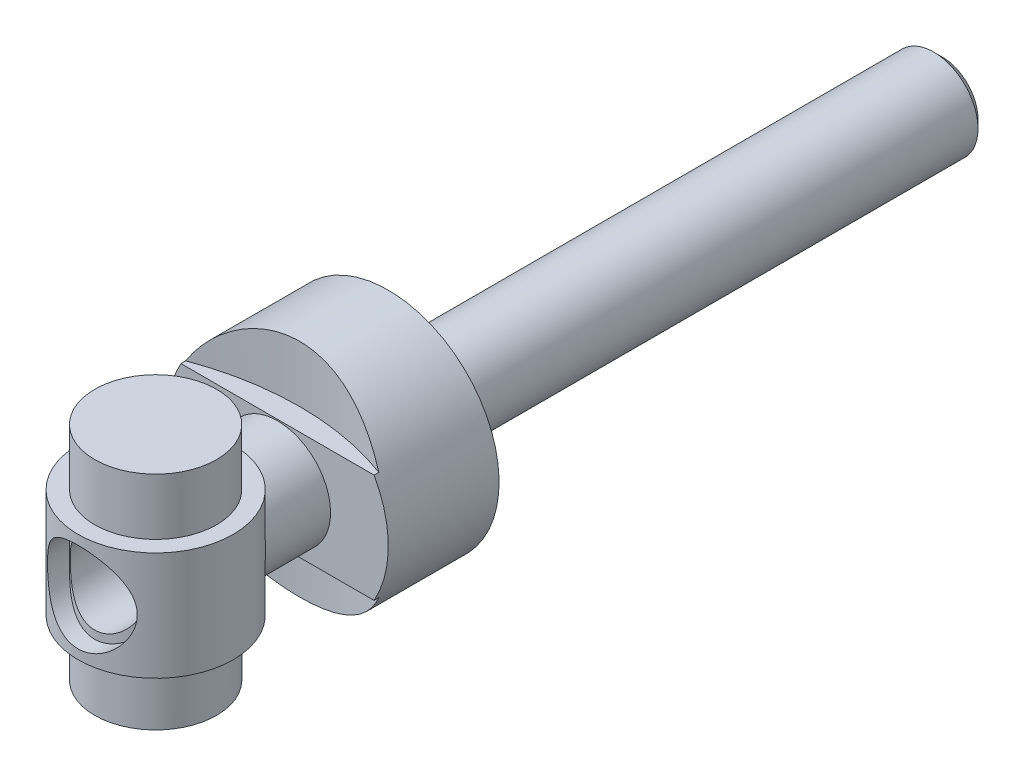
ISO-10303-21;
HEADER;
FILE_DESCRIPTION(('STEP AP214'),'2;1');
FILE_NAME('part.step','',(''),(''),'','','');
FILE_SCHEMA(('AUTOMOTIVE_DESIGN { 1 0 10303 214 1 1 1 1 }'));
ENDSEC;
DATA;
#1=APPLICATION_CONTEXT('core data for automotive mechanical design processes');
#2=APPLICATION_PROTOCOL_DEFINITION('international standard','automotive_design',2000,#1);
#3=PRODUCT_CONTEXT('',#1,'mechanical');
#4=PRODUCT('Part','Part','',(#3));
#5=PRODUCT_RELATED_PRODUCT_CATEGORY('part','',(#4));
#6=PRODUCT_DEFINITION_FORMATION('','',#4);
#7=PRODUCT_DEFINITION_CONTEXT('part definition',#1,'design');
#8=PRODUCT_DEFINITION('design','',#6,#7);
#9=PRODUCT_DEFINITION_SHAPE('','',#8);
#10=(LENGTH_UNIT() NAMED_UNIT(*) SI_UNIT(.MILLI.,.METRE.));
#11=(NAMED_UNIT(*) PLANE_ANGLE_UNIT() SI_UNIT($,.RADIAN.));
#12=(NAMED_UNIT(*) SI_UNIT($,.STERADIAN.) SOLID_ANGLE_UNIT());
#13=UNCERTAINTY_MEASURE_WITH_UNIT(LENGTH_MEASURE(1.E-05),#10,'distance_accuracy_value','');
#14=(GEOMETRIC_REPRESENTATION_CONTEXT(3) GLOBAL_UNCERTAINTY_ASSIGNED_CONTEXT((#13)) GLOBAL_UNIT_ASSIGNED_CONTEXT((#10,
#11,#12)) REPRESENTATION_CONTEXT('',''));
#15=CARTESIAN_POINT('',(0.,0.,0.));
#16=DIRECTION('',(0.,0.,1.));
#17=DIRECTION('',(1.,0.,0.));
#18=AXIS2_PLACEMENT_3D('',#15,#16,#17);
#19=CARTESIAN_POINT('',(-4.05,0.,2.56));
#20=DIRECTION('',(0.,0.,-1.));
#21=DIRECTION('',(0.,1.,0.));
#22=AXIS2_PLACEMENT_3D('',#19,#20,#21);
#23=PLANE('',#22);
#24=CARTESIAN_POINT('',(0.,0.,2.56));
#25=DIRECTION('',(0.,0.,1.));
#26=DIRECTION('',(0.,-1.,0.));
#27=AXIS2_PLACEMENT_3D('',#24,#25,#26);
#28=CIRCLE('',#27,4.05);
#29=CARTESIAN_POINT('',(0.,-4.05,2.56));
#30=VERTEX_POINT('',#29);
#31=EDGE_CURVE('E82',#30,#30,#28,.T.);
#32=ORIENTED_EDGE('',*,*,#31,.T.);
#33=EDGE_LOOP('',(#32));
#34=FACE_BOUND('',#33,.T.);
#35=ADVANCED_FACE('F14',(#34),#23,.F.);
#36=CARTESIAN_POINT('',(0.,-10.,21.));
#37=DIRECTION('',(0.,1.,0.));
#38=DIRECTION('',(-1.,0.,0.));
#39=AXIS2_PLACEMENT_3D('',#36,#37,#38);
#40=CYLINDRICAL_SURFACE('',#39,5.5);
#41=CARTESIAN_POINT('',(0.,3.3235,15.5));
#42=CARTESIAN_POINT('',(0.0849492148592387,3.32349929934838,15.5000006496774));
#43=CARTESIAN_POINT('',(0.169917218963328,3.32023787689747,15.5019731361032));
#44=CARTESIAN_POINT('',(0.339209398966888,3.3072351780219,15.509815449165));
#45=CARTESIAN_POINT('',(0.423533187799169,3.29749027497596,15.5156874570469));
#46=CARTESIAN_POINT('',(0.591008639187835,3.27162792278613,15.5311986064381));
#47=CARTESIAN_POINT('',(0.674157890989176,3.25549891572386,15.5408445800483));
#48=CARTESIAN_POINT('',(0.838540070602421,3.21708587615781,15.5636634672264));
#49=CARTESIAN_POINT('',(0.919772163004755,3.19479921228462,15.5768378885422));
#50=CARTESIAN_POINT('',(1.15890034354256,3.11935534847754,15.6210559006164));
#51=CARTESIAN_POINT('',(1.31325558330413,3.05745158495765,15.656895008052));
#52=CARTESIAN_POINT('',(1.6088114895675,2.91281917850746,15.7383172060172));
#53=CARTESIAN_POINT('',(1.75001509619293,2.83009520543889,15.7838981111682));
#54=CARTESIAN_POINT('',(2.02768642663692,2.63906699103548,15.8851248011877));
#55=CARTESIAN_POINT('',(2.1629504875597,2.52928266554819,15.9412755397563));
#56=CARTESIAN_POINT('',(2.41431534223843,2.29059769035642,16.0562928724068));
#57=CARTESIAN_POINT('',(2.53039095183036,2.16167233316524,16.1151629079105));
#58=CARTESIAN_POINT('',(2.75479201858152,1.86944686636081,16.2377101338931));
#59=CARTESIAN_POINT('',(2.86034345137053,1.70386486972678,16.3010706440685));
#60=CARTESIAN_POINT('',(3.04173942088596,1.3535894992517,16.4163964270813));
#61=CARTESIAN_POINT('',(3.11763255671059,1.16892802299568,16.4683802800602));
#62=CARTESIAN_POINT('',(3.22131586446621,0.831760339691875,16.5417346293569));
#63=CARTESIAN_POINT('',(3.25633055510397,0.68243262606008,16.5674826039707));
#64=CARTESIAN_POINT('',(3.30543031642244,0.378653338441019,16.6039674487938));
#65=CARTESIAN_POINT('',(3.31954198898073,0.224208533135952,16.614723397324));
#66=CARTESIAN_POINT('',(3.32601535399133,-0.0857285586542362,16.6196295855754));
#67=CARTESIAN_POINT('',(3.31833212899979,-0.24122234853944,16.6137455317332));
#68=CARTESIAN_POINT('',(3.28161489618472,-0.548276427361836,16.5862147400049));
#69=CARTESIAN_POINT('',(3.25256463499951,-0.699833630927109,16.5645560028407));
#70=CARTESIAN_POINT('',(3.17524997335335,-0.993037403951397,16.5088992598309));
#71=CARTESIAN_POINT('',(3.12726982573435,-1.1347956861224,16.4750844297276));
#72=CARTESIAN_POINT('',(3.0138782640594,-1.40860934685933,16.3987827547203));
#73=CARTESIAN_POINT('',(2.94846050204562,-1.54066116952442,16.3562927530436));
#74=CARTESIAN_POINT('',(2.78870894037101,-1.81614745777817,16.2583404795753));
#75=CARTESIAN_POINT('',(2.69130679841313,-1.95746158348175,16.2019131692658));
#76=CARTESIAN_POINT('',(2.47634416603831,-2.22320733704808,16.0875058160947));
#77=CARTESIAN_POINT('',(2.35876412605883,-2.34762238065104,16.0295243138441));
#78=CARTESIAN_POINT('',(2.08659455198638,-2.59423706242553,15.9087086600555));
#79=CARTESIAN_POINT('',(1.92911533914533,-2.71355617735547,15.8463723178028));
#80=CARTESIAN_POINT('',(1.67696871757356,-2.87111215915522,15.7611348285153));
#81=CARTESIAN_POINT('',(1.59022250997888,-2.92007760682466,15.7340898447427));
#82=CARTESIAN_POINT('',(1.41188187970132,-3.01035056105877,15.6835016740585));
#83=CARTESIAN_POINT('',(1.32029048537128,-3.05166278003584,15.6599563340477));
#84=CARTESIAN_POINT('',(1.13862377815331,-3.12380378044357,15.6183938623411));
#85=CARTESIAN_POINT('',(1.0487988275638,-3.15511946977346,15.6001265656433));
#86=CARTESIAN_POINT('',(0.866131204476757,-3.21007117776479,15.5678356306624));
#87=CARTESIAN_POINT('',(0.77329026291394,-3.23371151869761,15.5538096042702));
#88=CARTESIAN_POINT('',(0.58541564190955,-3.27294102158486,15.5304257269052));
#89=CARTESIAN_POINT('',(0.490383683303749,-3.28853629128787,15.5210643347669));
#90=CARTESIAN_POINT('',(0.298974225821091,-3.31142757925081,15.5072943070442));
#91=CARTESIAN_POINT('',(0.202596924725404,-3.31872480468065,15.5028849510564));
#92=CARTESIAN_POINT('',(0.0228456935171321,-3.32446433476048,15.4994174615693));
#93=CARTESIAN_POINT('',(-0.0604832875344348,-3.32399166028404,15.4997036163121));
#94=CARTESIAN_POINT('',(-0.226800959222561,-3.31679720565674,15.5040484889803));
#95=CARTESIAN_POINT('',(-0.309789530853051,-3.31007340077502,15.5081084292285));
#96=CARTESIAN_POINT('',(-0.474735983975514,-3.29046663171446,15.5199036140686));
#97=CARTESIAN_POINT('',(-0.556694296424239,-3.27758633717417,15.52763726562));
#98=CARTESIAN_POINT('',(-0.719043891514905,-3.24584075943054,15.5465908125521));
#99=CARTESIAN_POINT('',(-0.799434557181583,-3.22697316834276,15.5578120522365));
#100=CARTESIAN_POINT('',(-1.03312799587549,-3.1628871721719,15.5956491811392));
#101=CARTESIAN_POINT('',(-1.18358042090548,-3.10961193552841,15.6267950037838));
#102=CARTESIAN_POINT('',(-1.47327060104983,-2.98331442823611,15.698883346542));
#103=CARTESIAN_POINT('',(-1.61250620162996,-2.91028837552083,15.7398277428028));
#104=CARTESIAN_POINT('',(-1.89151203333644,-2.7381382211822,15.8331851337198));
#105=CARTESIAN_POINT('',(-2.02984738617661,-2.63709575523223,15.8863463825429));
#106=CARTESIAN_POINT('',(-2.28862856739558,-2.41596020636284,15.9967980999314));
#107=CARTESIAN_POINT('',(-2.40905334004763,-2.29584503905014,16.0540933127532));
#108=CARTESIAN_POINT('',(-2.64511011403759,-2.02139409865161,16.1757634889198));
#109=CARTESIAN_POINT('',(-2.75797500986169,-1.86463173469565,16.2400666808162));
#110=CARTESIAN_POINT('',(-2.95590606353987,-1.53156794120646,16.3603821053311));
#111=CARTESIAN_POINT('',(-3.04099999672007,-1.35528627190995,16.4164025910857));
#112=CARTESIAN_POINT('',(-3.16486148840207,-1.02624696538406,16.5013291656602));
#113=CARTESIAN_POINT('',(-3.20966055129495,-0.876606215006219,16.5334767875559));
#114=CARTESIAN_POINT('',(-3.27795062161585,-0.570290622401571,16.5833424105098));
#115=CARTESIAN_POINT('',(-3.3014719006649,-0.413626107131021,16.6010809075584));
#116=CARTESIAN_POINT('',(-3.32589708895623,-0.096853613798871,16.6195124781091));
#117=CARTESIAN_POINT('',(-3.32670905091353,0.0632657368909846,16.6201362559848));
#118=CARTESIAN_POINT('',(-3.30541937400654,0.381123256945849,16.6040519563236));
#119=CARTESIAN_POINT('',(-3.28330585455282,0.538860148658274,16.5873348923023));
#120=CARTESIAN_POINT('',(-3.21931166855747,0.839051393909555,16.5404627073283));
#121=CARTESIAN_POINT('',(-3.17854865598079,0.981872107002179,16.511072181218));
#122=CARTESIAN_POINT('',(-3.07942979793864,1.2587337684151,16.4425083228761));
#123=CARTESIAN_POINT('',(-3.02106727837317,1.39277136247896,16.4033312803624));
#124=CARTESIAN_POINT('',(-2.87819061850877,1.67021045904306,16.3123327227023));
#125=CARTESIAN_POINT('',(-2.79104460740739,1.81191880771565,16.2594939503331));
#126=CARTESIAN_POINT('',(-2.59734448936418,2.08010791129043,16.1506539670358));
#127=CARTESIAN_POINT('',(-2.49077432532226,2.20657592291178,16.0946501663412));
#128=CARTESIAN_POINT('',(-2.24012141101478,2.4626873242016,15.9746350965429));
#129=CARTESIAN_POINT('',(-2.09274242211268,2.58924551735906,15.9108727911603));
#130=CARTESIAN_POINT('',(-1.77562155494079,2.81615632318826,15.7917605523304));
#131=CARTESIAN_POINT('',(-1.60587083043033,2.91649852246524,15.7364139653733));
#132=CARTESIAN_POINT('',(-1.33985548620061,3.04299160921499,15.6649272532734));
#133=CARTESIAN_POINT('',(-1.25047857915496,3.08082050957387,15.6432245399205));
#134=CARTESIAN_POINT('',(-1.06798658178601,3.14873230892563,15.6038819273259));
#135=CARTESIAN_POINT('',(-0.974873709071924,3.17881972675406,15.5862396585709));
#136=CARTESIAN_POINT('',(-0.785926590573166,3.23071936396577,15.5556029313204));
#137=CARTESIAN_POINT('',(-0.690101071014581,3.25255545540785,15.5425950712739));
#138=CARTESIAN_POINT('',(-0.496410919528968,3.28768905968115,15.5215835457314));
#139=CARTESIAN_POINT('',(-0.398548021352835,3.30099354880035,15.5135757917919));
#140=CARTESIAN_POINT('',(-0.250330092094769,3.31443769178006,15.5054723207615));
#141=CARTESIAN_POINT('',(-0.200351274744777,3.31783397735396,15.5034222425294));
#142=CARTESIAN_POINT('',(-0.100250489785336,3.32236538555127,15.5006858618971));
#143=CARTESIAN_POINT('',(-0.050128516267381,3.32350041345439,15.4999996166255));
#144=CARTESIAN_POINT('',(0.,3.3235,15.5));
#145=B_SPLINE_CURVE_WITH_KNOTS('',3,(#41,#42,#43,#44,#45,#46,#47,#48,#49,#50,#51,#52,#53,#54,
#55,#56,#57,#58,#59,#60,#61,#62,#63,#64,#65,#66,#67,#68,#69,#70,#71,#72,#73,#74,#75,#76,#77,#78,
#79,#80,#81,#82,#83,#84,#85,#86,#87,#88,#89,#90,#91,#92,#93,#94,#95,#96,#97,#98,#99,#100,#101,
#102,#103,#104,#105,#106,#107,#108,#109,#110,#111,#112,#113,#114,#115,#116,#117,#118,#119,#120,
#121,#122,#123,#124,#125,#126,#127,#128,#129,#130,#131,#132,#133,#134,#135,#136,#137,#138,#139,
#140,#141,#142,#143,#144),.UNSPECIFIED.,.T.,.F.,(4,2,2,2,2,2,2,2,2,2,2,2,2,2,2,2,2,2,2,2,2,2,2,
2,2,2,2,2,2,2,2,2,2,2,2,2,2,2,2,2,2,2,2,2,2,2,2,2,2,2,2,4),(0.,0.254794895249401,
0.509732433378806,0.76513364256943,1.02064416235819,1.52857060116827,2.03638321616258,
2.58333197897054,3.13099298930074,3.74698603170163,4.36196541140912,4.82656808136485,
5.29057897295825,5.75554684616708,6.22086877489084,6.67945420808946,7.13820681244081,
7.67813288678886,8.21858505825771,8.83660104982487,9.14588801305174,9.45498389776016,
9.74516004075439,10.0351724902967,10.3249644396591,10.6147142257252,10.8643933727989,
11.1141534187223,11.3638052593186,11.6135534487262,12.0991916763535,12.584922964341,
13.1209048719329,13.6575119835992,14.2654801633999,14.8728384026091,15.3493138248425,
15.8251103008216,16.3028329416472,16.780803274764,17.2332709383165,17.6859104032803,
18.2076339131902,18.729790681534,19.3403209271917,19.9510933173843,20.2490683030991,
20.5468689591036,20.8438013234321,21.1404905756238,21.2908386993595,21.4411931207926),.UNSPECIFIED.);
#146=CARTESIAN_POINT('',(0.,3.3235,15.5));
#147=VERTEX_POINT('',#146);
#148=EDGE_CURVE('E23',#147,#147,#145,.T.);
#149=ORIENTED_EDGE('',*,*,#148,.F.);
#150=EDGE_LOOP('',(#149));
#151=FACE_BOUND('',#150,.T.);
#152=CARTESIAN_POINT('',(0.,-4.05,15.5));
#153=CARTESIAN_POINT('',(-0.0993570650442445,-4.04999906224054,15.5000009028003));
#154=CARTESIAN_POINT('',(-0.198736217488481,-4.04633711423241,15.5026989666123));
#155=CARTESIAN_POINT('',(-0.39671110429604,-4.03174697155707,15.5134291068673));
#156=CARTESIAN_POINT('',(-0.495306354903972,-4.02081459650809,15.5214642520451));
#157=CARTESIAN_POINT('',(-0.691072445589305,-3.99183199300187,15.5426999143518));
#158=CARTESIAN_POINT('',(-0.788240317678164,-3.97376865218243,15.555909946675));
#159=CARTESIAN_POINT('',(-0.980271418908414,-3.93081016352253,15.5871859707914));
#160=CARTESIAN_POINT('',(-1.07513360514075,-3.90591198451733,15.6052541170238));
#161=CARTESIAN_POINT('',(-1.35409912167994,-3.82183066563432,15.6659245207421));
#162=CARTESIAN_POINT('',(-1.53398234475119,-3.75304653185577,15.7151530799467));
#163=CARTESIAN_POINT('',(-1.87842899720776,-3.59307140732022,15.8275313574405));
#164=CARTESIAN_POINT('',(-2.04299662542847,-3.50188658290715,15.89067724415));
#165=CARTESIAN_POINT('',(-2.3694507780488,-3.29080050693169,16.0330859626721));
#166=CARTESIAN_POINT('',(-2.52971012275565,-3.16903363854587,16.113295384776));
#167=CARTESIAN_POINT('',(-2.82896593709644,-2.90505815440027,16.28021769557));
#168=CARTESIAN_POINT('',(-2.96792857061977,-2.76281769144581,16.3669406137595));
#169=CARTESIAN_POINT('',(-3.17207728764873,-2.52080567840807,16.505948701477));
#170=CARTESIAN_POINT('',(-3.24447848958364,-2.42692197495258,16.5580759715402));
#171=CARTESIAN_POINT('',(-3.38108588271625,-2.23268066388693,16.661155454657));
#172=CARTESIAN_POINT('',(-3.44528968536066,-2.13232118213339,16.7121073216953));
#173=CARTESIAN_POINT('',(-3.565049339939,-1.92540561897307,16.8111511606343));
#174=CARTESIAN_POINT('',(-3.62061622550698,-1.81885768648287,16.8592467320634));
#175=CARTESIAN_POINT('',(-3.72268090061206,-1.59961965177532,16.9507601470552));
#176=CARTESIAN_POINT('',(-3.76918031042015,-1.48693065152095,16.9941788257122));
#177=CARTESIAN_POINT('',(-3.86611887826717,-1.21747318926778,17.0873255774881));
#178=CARTESIAN_POINT('',(-3.91284278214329,-1.05837570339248,17.1344478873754));
#179=CARTESIAN_POINT('',(-3.96833386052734,-0.813533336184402,17.1917155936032));
#180=CARTESIAN_POINT('',(-3.98439338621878,-0.730935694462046,17.2085630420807));
#181=CARTESIAN_POINT('',(-4.01141882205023,-0.564049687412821,17.237167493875));
#182=CARTESIAN_POINT('',(-4.02238684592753,-0.479762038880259,17.2489266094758));
#183=CARTESIAN_POINT('',(-4.03908228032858,-0.309361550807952,17.2669090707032));
#184=CARTESIAN_POINT('',(-4.04476533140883,-0.223239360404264,17.2730855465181));
#185=CARTESIAN_POINT('',(-4.05060492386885,-0.0505861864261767,17.279432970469));
#186=CARTESIAN_POINT('',(-4.05076169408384,0.0359447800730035,17.2796041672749));
#187=CARTESIAN_POINT('',(-4.04554383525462,0.208670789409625,17.2739311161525));
#188=CARTESIAN_POINT('',(-4.04016718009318,0.294865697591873,17.2680846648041));
#189=CARTESIAN_POINT('',(-4.02399993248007,0.466191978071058,17.2506581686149));
#190=CARTESIAN_POINT('',(-4.01320661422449,0.551322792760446,17.2390752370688));
#191=CARTESIAN_POINT('',(-3.98502218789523,0.728683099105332,17.2092137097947));
#192=CARTESIAN_POINT('',(-3.96705962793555,0.82072512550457,17.1903620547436));
#193=CARTESIAN_POINT('',(-3.92515914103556,1.00215252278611,17.1472047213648));
#194=CARTESIAN_POINT('',(-3.90121721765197,1.09153607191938,17.1228953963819));
#195=CARTESIAN_POINT('',(-3.82090378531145,1.35536092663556,17.0431883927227));
#196=CARTESIAN_POINT('',(-3.75607760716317,1.52527663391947,16.9810490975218));
#197=CARTESIAN_POINT('',(-3.63064807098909,1.79881292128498,16.8680424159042));
#198=CARTESIAN_POINT('',(-3.57538534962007,1.90618715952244,16.8199722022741));
#199=CARTESIAN_POINT('',(-3.45617502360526,2.1146533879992,16.7208813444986));
#200=CARTESIAN_POINT('',(-3.39222454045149,2.2157432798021,16.6698597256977));
#201=CARTESIAN_POINT('',(-3.25597774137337,2.41150281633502,16.5664991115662));
#202=CARTESIAN_POINT('',(-3.18367605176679,2.50616826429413,16.5141592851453));
#203=CARTESIAN_POINT('',(-3.0309513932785,2.68886837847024,16.4095856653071));
#204=CARTESIAN_POINT('',(-2.95052439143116,2.77689971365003,16.3573519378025));
#205=CARTESIAN_POINT('',(-2.78051000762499,2.94719390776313,16.2535455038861));
#206=CARTESIAN_POINT('',(-2.69080481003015,3.02935228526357,16.2019939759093));
#207=CARTESIAN_POINT('',(-2.50345701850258,3.18592277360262,16.1016332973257));
#208=CARTESIAN_POINT('',(-2.40581545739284,3.26033588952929,16.052823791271));
#209=CARTESIAN_POINT('',(-2.20303487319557,3.40063241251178,15.9592585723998));
#210=CARTESIAN_POINT('',(-2.09790983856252,3.46653111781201,15.9144956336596));
#211=CARTESIAN_POINT('',(-1.88051729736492,3.5891132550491,15.8301585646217));
#212=CARTESIAN_POINT('',(-1.76825248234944,3.64580013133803,15.7905824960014));
#213=CARTESIAN_POINT('',(-1.48073538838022,3.77429697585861,15.7000166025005));
#214=CARTESIAN_POINT('',(-1.30144840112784,3.84001502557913,15.6528629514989));
#215=CARTESIAN_POINT('',(-0.931961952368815,3.94599025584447,15.5762560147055));
#216=CARTESIAN_POINT('',(-0.741770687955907,3.98626629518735,15.546789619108));
#217=CARTESIAN_POINT('',(-0.354695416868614,4.0391783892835,15.5079939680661));
#218=CARTESIAN_POINT('',(-0.157787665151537,4.05170314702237,15.4987458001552));
#219=CARTESIAN_POINT('',(0.235599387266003,4.04792309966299,15.5015294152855));
#220=CARTESIAN_POINT('',(0.432078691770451,4.03161855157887,15.513561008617));
#221=CARTESIAN_POINT('',(0.806141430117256,3.97318966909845,15.5563451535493));
#222=CARTESIAN_POINT('',(0.984136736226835,3.9327506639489,15.5858749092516));
#223=CARTESIAN_POINT('',(1.33010781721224,3.82961187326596,15.6603224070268));
#224=CARTESIAN_POINT('',(1.49808147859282,3.76690741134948,15.7052433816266));
#225=CARTESIAN_POINT('',(1.83368497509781,3.61614914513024,15.8114600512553));
#226=CARTESIAN_POINT('',(2.00027735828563,3.52650625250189,15.8737556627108));
#227=CARTESIAN_POINT('',(2.31650130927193,3.32735557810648,16.0086644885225));
#228=CARTESIAN_POINT('',(2.46612272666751,3.21783600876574,16.0812838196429));
#229=CARTESIAN_POINT('',(2.7731254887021,2.95965715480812,16.2465331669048));
#230=CARTESIAN_POINT('',(2.926904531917,2.80750324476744,16.3403915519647));
#231=CARTESIAN_POINT('',(3.20827510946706,2.48112331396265,16.5294621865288));
#232=CARTESIAN_POINT('',(3.33584080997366,2.30687579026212,16.624675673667));
#233=CARTESIAN_POINT('',(3.552786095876,1.95425132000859,16.7993697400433));
#234=CARTESIAN_POINT('',(3.64458120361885,1.77768582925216,16.8794938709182));
#235=CARTESIAN_POINT('',(3.80271479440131,1.40787267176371,17.0249652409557));
#236=CARTESIAN_POINT('',(3.86910593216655,1.21466053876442,17.0903429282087));
#237=CARTESIAN_POINT('',(3.96047028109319,0.861433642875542,17.1832080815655));
#238=CARTESIAN_POINT('',(3.99153435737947,0.70442685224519,17.2160060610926));
#239=CARTESIAN_POINT('',(4.03485153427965,0.385128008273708,17.2622169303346));
#240=CARTESIAN_POINT('',(4.04713479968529,0.222844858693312,17.2756609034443));
#241=CARTESIAN_POINT('',(4.05197594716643,-0.102823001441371,17.2809255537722));
#242=CARTESIAN_POINT('',(4.0444810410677,-0.26620949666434,17.2726883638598));
#243=CARTESIAN_POINT('',(4.0102782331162,-0.588690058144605,17.2359263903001));
#244=CARTESIAN_POINT('',(3.98354421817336,-0.747777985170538,17.2073740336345));
#245=CARTESIAN_POINT('',(3.90275154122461,-1.10108775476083,17.1240852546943));
#246=CARTESIAN_POINT('',(3.84317012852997,-1.2928133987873,17.0642824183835));
#247=CARTESIAN_POINT('',(3.69912200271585,-1.66079969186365,16.9286064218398));
#248=CARTESIAN_POINT('',(3.61458958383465,-1.83701789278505,16.852690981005));
#249=CARTESIAN_POINT('',(3.45747436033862,-2.11275748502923,16.7218804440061));
#250=CARTESIAN_POINT('',(3.3914376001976,-2.21716169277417,16.6691828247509));
#251=CARTESIAN_POINT('',(3.25047521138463,-2.41910773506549,16.5624083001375));
#252=CARTESIAN_POINT('',(3.17554705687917,-2.51664760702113,16.5083310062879));
#253=CARTESIAN_POINT('',(3.01713889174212,-2.7045247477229,16.4004292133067));
#254=CARTESIAN_POINT('',(2.93366523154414,-2.79486727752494,16.3466045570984));
#255=CARTESIAN_POINT('',(2.75832473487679,-2.96805300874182,16.2405717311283));
#256=CARTESIAN_POINT('',(2.66645619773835,-3.05089468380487,16.1883638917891));
#257=CARTESIAN_POINT('',(2.40810862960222,-3.26306939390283,16.0518016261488));
#258=CARTESIAN_POINT('',(2.23392568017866,-3.3849902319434,15.9701518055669));
#259=CARTESIAN_POINT('',(1.86395112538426,-3.60195515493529,15.8216453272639));
#260=CARTESIAN_POINT('',(1.66818307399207,-3.69702814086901,15.7547727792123));
#261=CARTESIAN_POINT('',(1.28996040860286,-3.84356560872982,15.6503945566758));
#262=CARTESIAN_POINT('',(1.11007473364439,-3.89948380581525,15.6099567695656));
#263=CARTESIAN_POINT('',(0.833834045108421,-3.96436505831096,15.5627687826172));
#264=CARTESIAN_POINT('',(0.740750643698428,-3.98282002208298,15.549288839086));
#265=CARTESIAN_POINT('',(0.552981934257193,-4.01319498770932,15.5270553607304));
#266=CARTESIAN_POINT('',(0.458297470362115,-4.02511832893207,15.5182994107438));
#267=CARTESIAN_POINT('',(0.302888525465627,-4.03911218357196,15.50801354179));
#268=CARTESIAN_POINT('',(0.242430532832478,-4.04319201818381,15.5050115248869));
#269=CARTESIAN_POINT('',(0.121317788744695,-4.04863640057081,15.5010043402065));
#270=CARTESIAN_POINT('',(0.0606630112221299,-4.05000057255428,15.4999994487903));
#271=CARTESIAN_POINT('',(0.,-4.05,15.5));
#272=B_SPLINE_CURVE_WITH_KNOTS('',3,(#152,#153,#154,#155,#156,#157,#158,#159,#160,#161,#162,
#163,#164,#165,#166,#167,#168,#169,#170,#171,#172,#173,#174,#175,#176,#177,#178,#179,#180,#181,
#182,#183,#184,#185,#186,#187,#188,#189,#190,#191,#192,#193,#194,#195,#196,#197,#198,#199,#200,
#201,#202,#203,#204,#205,#206,#207,#208,#209,#210,#211,#212,#213,#214,#215,#216,#217,#218,#219,
#220,#221,#222,#223,#224,#225,#226,#227,#228,#229,#230,#231,#232,#233,#234,#235,#236,#237,#238,
#239,#240,#241,#242,#243,#244,#245,#246,#247,#248,#249,#250,#251,#252,#253,#254,#255,#256,#257,
#258,#259,#260,#261,#262,#263,#264,#265,#266,#267,#268,#269,#270,#271),.UNSPECIFIED.,.T.,.F.,(4,
2,2,2,2,2,2,2,2,2,2,2,2,2,2,2,2,2,2,2,2,2,2,2,2,2,2,2,2,2,2,2,2,2,2,2,2,2,2,2,2,2,2,2,2,2,2,2,2,
2,2,2,2,2,2,2,2,2,2,4),(0.,0.298005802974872,0.596183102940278,0.894911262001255,
1.19377211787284,1.78727078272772,2.3806062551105,3.0283052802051,3.67702292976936,
4.06519337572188,4.45347666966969,4.8412597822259,5.22897353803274,5.74392888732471,
6.00111157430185,6.25818739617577,6.5174020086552,6.77660588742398,7.03590470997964,
7.29533414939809,7.5818649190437,7.86858771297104,8.44264340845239,8.8321755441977,
9.22183705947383,9.61175071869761,10.0018588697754,10.3977324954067,10.7935546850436,
11.1886554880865,11.5836082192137,12.1710259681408,12.7580077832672,13.3473394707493,
13.9366659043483,14.4889922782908,15.0414347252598,15.6367315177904,16.2323825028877,
16.9371857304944,17.6426802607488,18.2841179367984,18.9242188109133,19.4123615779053,
19.8997194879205,20.3883794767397,20.8777039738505,21.502770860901,22.129498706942,
22.5319871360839,22.934590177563,23.33689617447,23.7392838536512,24.419617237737,
25.0992154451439,25.6744980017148,25.9617485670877,26.2488521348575,26.4307760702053,
26.6127251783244),.UNSPECIFIED.);
#273=CARTESIAN_POINT('',(0.,-4.05,15.5));
#274=VERTEX_POINT('',#273);
#275=EDGE_CURVE('E133',#274,#274,#272,.T.);
#276=ORIENTED_EDGE('',*,*,#275,.T.);
#277=EDGE_LOOP('',(#276));
#278=FACE_BOUND('',#277,.T.);
#279=ADVANCED_FACE('F188',(#151,#278),#40,.T.);
#280=CARTESIAN_POINT('',(0.,0.,2.56));
#281=DIRECTION('',(0.,0.,1.));
#282=DIRECTION('',(0.,-1.,0.));
#283=AXIS2_PLACEMENT_3D('',#280,#281,#282);
#284=CYLINDRICAL_SURFACE('',#283,4.05);
#285=ORIENTED_EDGE('',*,*,#31,.F.);
#286=EDGE_LOOP('',(#285));
#287=FACE_BOUND('',#286,.T.);
#288=ORIENTED_EDGE('',*,*,#275,.F.);
#289=EDGE_LOOP('',(#288));
#290=FACE_BOUND('',#289,.T.);
#291=ADVANCED_FACE('F151',(#287,#290),#284,.F.);
#292=CARTESIAN_POINT('',(0.,0.,15.5));
#293=DIRECTION('',(0.,0.,1.));
#294=DIRECTION('',(1.,0.,0.));
#295=AXIS2_PLACEMENT_3D('',#292,#293,#294);
#296=CYLINDRICAL_SURFACE('',#295,3.3235);
#297=ORIENTED_EDGE('',*,*,#148,.T.);
#298=EDGE_LOOP('',(#297));
#299=FACE_BOUND('',#298,.T.);
#300=CARTESIAN_POINT('',(3.3235,0.,25.3822765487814));
#301=CARTESIAN_POINT('',(3.32349911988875,0.0833292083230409,25.3822778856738));
#302=CARTESIAN_POINT('',(3.3203594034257,0.166689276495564,25.3846638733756));
#303=CARTESIAN_POINT('',(3.3078535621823,0.332712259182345,25.3941055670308));
#304=CARTESIAN_POINT('',(3.29848300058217,0.415374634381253,25.4011646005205));
#305=CARTESIAN_POINT('',(3.27364501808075,0.579483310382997,25.4196705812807));
#306=CARTESIAN_POINT('',(3.25816320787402,0.660926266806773,25.4311278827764));
#307=CARTESIAN_POINT('',(3.22134571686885,0.821832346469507,25.4579645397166));
#308=CARTESIAN_POINT('',(3.20000715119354,0.901294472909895,25.4733458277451));
#309=CARTESIAN_POINT('',(3.12803400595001,1.13461533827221,25.5242509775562));
#310=CARTESIAN_POINT('',(3.06920134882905,1.28494760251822,25.5647276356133));
#311=CARTESIAN_POINT('',(2.93186432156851,1.57334206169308,25.6541232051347));
#312=CARTESIAN_POINT('',(2.85336193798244,1.71140549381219,25.7030412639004));
#313=CARTESIAN_POINT('',(2.66748262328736,1.99038627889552,25.8111811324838));
#314=CARTESIAN_POINT('',(2.55772849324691,2.12952188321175,25.8709276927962));
#315=CARTESIAN_POINT('',(2.31737139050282,2.38888604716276,25.9897721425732));
#316=CARTESIAN_POINT('',(2.18675112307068,2.50909875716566,26.0488694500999));
#317=CARTESIAN_POINT('',(1.89076420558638,2.74036179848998,26.1674957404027));
#318=CARTESIAN_POINT('',(1.7231556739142,2.84894800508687,26.2263565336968));
#319=CARTESIAN_POINT('',(1.4569246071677,2.98883133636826,26.3043369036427));
#320=CARTESIAN_POINT('',(1.365681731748,3.03163579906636,26.3286176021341));
#321=CARTESIAN_POINT('',(1.17883903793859,3.10905008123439,26.3730371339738));
#322=CARTESIAN_POINT('',(1.08324217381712,3.14366536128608,26.3931787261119));
#323=CARTESIAN_POINT('',(0.897823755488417,3.20126029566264,26.4269629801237));
#324=CARTESIAN_POINT('',(0.808328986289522,3.22503803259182,26.44104395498));
#325=CARTESIAN_POINT('',(0.627158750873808,3.26510710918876,26.4648890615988));
#326=CARTESIAN_POINT('',(0.535484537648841,3.28140264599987,26.4746556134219));
#327=CARTESIAN_POINT('',(0.350764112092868,3.30625037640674,26.4895845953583));
#328=CARTESIAN_POINT('',(0.257718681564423,3.31480682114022,26.4947495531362));
#329=CARTESIAN_POINT('',(0.0711277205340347,3.32405370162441,26.5003338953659));
#330=CARTESIAN_POINT('',(-0.0224177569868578,3.32474495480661,26.5007537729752));
#331=CARTESIAN_POINT('',(-0.278953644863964,3.315781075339,26.4953337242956));
#332=CARTESIAN_POINT('',(-0.441651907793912,3.29801660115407,26.4845865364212));
#333=CARTESIAN_POINT('',(-0.761142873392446,3.23925299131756,26.4494559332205));
#334=CARTESIAN_POINT('',(-0.917935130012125,3.19825210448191,26.4250714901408));
#335=CARTESIAN_POINT('',(-1.22270945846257,3.09462088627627,26.3646292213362));
#336=CARTESIAN_POINT('',(-1.37064057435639,3.03187735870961,26.3285103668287));
#337=CARTESIAN_POINT('',(-1.65403755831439,2.88706944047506,26.2474681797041));
#338=CARTESIAN_POINT('',(-1.78950025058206,2.80500014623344,26.2025426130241));
#339=CARTESIAN_POINT('',(-2.06160271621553,2.61274603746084,26.1013049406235));
#340=CARTESIAN_POINT('',(-2.19642236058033,2.50036629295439,26.044273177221));
#341=CARTESIAN_POINT('',(-2.4464483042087,2.25635117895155,25.9278756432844));
#342=CARTESIAN_POINT('',(-2.56162720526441,2.12468937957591,25.8685067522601));
#343=CARTESIAN_POINT('',(-2.78289616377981,1.82741281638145,25.7458711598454));
#344=CARTESIAN_POINT('',(-2.88629628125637,1.65962379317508,25.6829749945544));
#345=CARTESIAN_POINT('',(-3.062895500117,1.30512353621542,25.5694364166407));
#346=CARTESIAN_POINT('',(-3.13615037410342,1.11844804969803,25.5187714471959));
#347=CARTESIAN_POINT('',(-3.23438198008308,0.779306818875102,25.4487592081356));
#348=CARTESIAN_POINT('',(-3.26685405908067,0.629977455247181,25.4247468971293));
#349=CARTESIAN_POINT('',(-3.31093990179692,0.32670209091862,25.3918639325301));
#350=CARTESIAN_POINT('',(-3.32257861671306,0.172761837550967,25.3829751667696));
#351=CARTESIAN_POINT('',(-3.32431718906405,-0.135543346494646,25.3816569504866));
#352=CARTESIAN_POINT('',(-3.31438419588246,-0.28990856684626,25.3892526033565));
#353=CARTESIAN_POINT('',(-3.27354081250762,-0.594316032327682,25.4197907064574));
#354=CARTESIAN_POINT('',(-3.24261367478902,-0.744354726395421,25.4427454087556));
#355=CARTESIAN_POINT('',(-3.16153602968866,-1.03594739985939,25.5007923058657));
#356=CARTESIAN_POINT('',(-3.11145579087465,-1.1775302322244,25.5358400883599));
#357=CARTESIAN_POINT('',(-2.99386164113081,-1.45072167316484,25.6143019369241));
#358=CARTESIAN_POINT('',(-2.92634123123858,-1.58232653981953,25.6577191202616));
#359=CARTESIAN_POINT('',(-2.76159656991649,-1.8572499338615,25.7575669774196));
#360=CARTESIAN_POINT('',(-2.66120186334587,-1.99833468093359,25.8149274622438));
#361=CARTESIAN_POINT('',(-2.44003232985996,-2.26312267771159,25.9307079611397));
#362=CARTESIAN_POINT('',(-2.31923766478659,-2.38680879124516,25.9891289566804));
#363=CARTESIAN_POINT('',(-2.04109217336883,-2.63022749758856,26.1097750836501));
#364=CARTESIAN_POINT('',(-1.88100795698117,-2.74717416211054,26.1714496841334));
#365=CARTESIAN_POINT('',(-1.62516509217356,-2.90076197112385,26.2551834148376));
#366=CARTESIAN_POINT('',(-1.53722586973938,-2.9483340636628,26.2816405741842));
#367=CARTESIAN_POINT('',(-1.35659771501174,-3.03567747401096,26.3308890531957));
#368=CARTESIAN_POINT('',(-1.26391182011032,-3.07545370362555,26.3536826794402));
#369=CARTESIAN_POINT('',(-1.08111529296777,-3.14415294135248,26.3934515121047));
#370=CARTESIAN_POINT('',(-0.991281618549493,-3.17364232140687,26.4107230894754));
#371=CARTESIAN_POINT('',(-0.80879735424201,-3.22497664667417,26.4409917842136));
#372=CARTESIAN_POINT('',(-0.716148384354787,-3.24682590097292,26.4539913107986));
#373=CARTESIAN_POINT('',(-0.528860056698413,-3.28253570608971,26.4753249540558));
#374=CARTESIAN_POINT('',(-0.434222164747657,-3.2964019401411,26.4836623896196));
#375=CARTESIAN_POINT('',(-0.243806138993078,-3.31592644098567,26.4954212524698));
#376=CARTESIAN_POINT('',(-0.148028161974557,-3.32158582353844,26.498843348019));
#377=CARTESIAN_POINT('',(0.0306413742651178,-3.3243904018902,26.5005380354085));
#378=CARTESIAN_POINT('',(0.113511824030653,-3.32258999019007,26.4994483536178));
#379=CARTESIAN_POINT('',(0.278763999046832,-3.31282474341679,26.4935548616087));
#380=CARTESIAN_POINT('',(0.361145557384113,-3.30485791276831,26.4887498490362));
#381=CARTESIAN_POINT('',(0.606555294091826,-3.27183454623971,26.4689031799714));
#382=CARTESIAN_POINT('',(0.768034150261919,-3.23765773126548,26.4484313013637));
#383=CARTESIAN_POINT('',(1.07910076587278,-3.14753673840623,26.3953732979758));
#384=CARTESIAN_POINT('',(1.22885605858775,-3.0920180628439,26.3630245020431));
#385=CARTESIAN_POINT('',(1.51694846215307,-2.96134187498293,26.2887620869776));
#386=CARTESIAN_POINT('',(1.65528318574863,-2.88618027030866,26.2468464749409));
#387=CARTESIAN_POINT('',(1.93270004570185,-2.70928865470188,26.1515477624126));
#388=CARTESIAN_POINT('',(2.07025026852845,-2.60556626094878,26.0974151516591));
#389=CARTESIAN_POINT('',(2.32706124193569,-2.37903608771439,25.9854243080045));
#390=CARTESIAN_POINT('',(2.44630046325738,-2.25620617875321,25.9275618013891));
#391=CARTESIAN_POINT('',(2.67904554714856,-1.97627936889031,25.8054274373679));
#392=CARTESIAN_POINT('',(2.78978667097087,-1.81680331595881,25.7413012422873));
#393=CARTESIAN_POINT('',(2.98293771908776,-1.47838441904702,25.6222265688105));
#394=CARTESIAN_POINT('',(3.06537022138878,-1.29945723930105,25.5672707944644));
#395=CARTESIAN_POINT('',(3.18332386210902,-0.967353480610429,25.4855806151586));
#396=CARTESIAN_POINT('',(3.2252104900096,-0.817351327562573,25.4552844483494));
#397=CARTESIAN_POINT('',(3.27204912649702,-0.58775255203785,25.4208652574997));
#398=CARTESIAN_POINT('',(3.28499149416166,-0.51053820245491,25.4112341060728));
#399=CARTESIAN_POINT('',(3.30541246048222,-0.35501637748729,25.3959547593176));
#400=CARTESIAN_POINT('',(3.31289440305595,-0.276709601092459,25.3903041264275));
#401=CARTESIAN_POINT('',(3.31955633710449,-0.165200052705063,25.3852650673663));
#402=CARTESIAN_POINT('',(3.3210344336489,-0.132191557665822,25.3841455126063));
#403=CARTESIAN_POINT('',(3.32300651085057,-0.0661236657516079,25.3826509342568));
#404=CARTESIAN_POINT('',(3.32350034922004,-0.033064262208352,25.3822760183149));
#405=CARTESIAN_POINT('',(3.3235,0.,25.3822765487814));
#406=B_SPLINE_CURVE_WITH_KNOTS('',3,(#300,#301,#302,#303,#304,#305,#306,#307,#308,#309,#310,
#311,#312,#313,#314,#315,#316,#317,#318,#319,#320,#321,#322,#323,#324,#325,#326,#327,#328,#329,
#330,#331,#332,#333,#334,#335,#336,#337,#338,#339,#340,#341,#342,#343,#344,#345,#346,#347,#348,
#349,#350,#351,#352,#353,#354,#355,#356,#357,#358,#359,#360,#361,#362,#363,#364,#365,#366,#367,
#368,#369,#370,#371,#372,#373,#374,#375,#376,#377,#378,#379,#380,#381,#382,#383,#384,#385,#386,
#387,#388,#389,#390,#391,#392,#393,#394,#395,#396,#397,#398,#399,#400,#401,#402,#403,#404,#405),
.UNSPECIFIED.,.T.,.F.,(4,2,2,2,2,2,2,2,2,2,2,2,2,2,2,2,2,2,2,2,2,2,2,2,2,2,2,2,2,2,2,2,2,2,2,2,
2,2,2,2,2,2,2,2,2,2,2,2,2,2,2,2,4),(0.,0.249948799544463,0.500075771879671,0.750795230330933,
1.00163840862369,1.49867656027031,1.99566453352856,2.5544808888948,3.11376284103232,
3.73459233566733,4.04519272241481,4.35558541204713,4.63617561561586,4.91660822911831,
5.19688670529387,5.47713605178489,5.96660521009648,6.45611126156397,6.94820504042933,
7.44042381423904,7.99187692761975,8.54409311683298,9.16167922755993,9.77811753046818,
10.240221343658,10.7017713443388,11.1640247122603,11.6266472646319,12.0875885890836,
12.548701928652,13.0938192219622,13.6394697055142,14.2587541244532,14.568647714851,
14.8783454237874,15.1662732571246,15.4540384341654,15.7415984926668,16.0291194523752,
16.277490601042,16.5259421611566,17.022295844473,17.5092277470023,17.9962611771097,
18.5358791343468,19.0761267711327,19.6866692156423,20.2967235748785,20.7705222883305,
21.0069196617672,21.2431721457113,21.3423351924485,21.4415125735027),.UNSPECIFIED.);
#407=CARTESIAN_POINT('',(3.3235,0.,25.3822765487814));
#408=VERTEX_POINT('',#407);
#409=EDGE_CURVE('E209',#408,#408,#406,.T.);
#410=ORIENTED_EDGE('',*,*,#409,.T.);
#411=EDGE_LOOP('',(#410));
#412=FACE_BOUND('',#411,.T.);
#413=ADVANCED_FACE('F219',(#299,#412),#296,.F.);
#414=CARTESIAN_POINT('',(0.,4.9,21.));
#415=DIRECTION('',(0.,-1.,0.));
#416=DIRECTION('',(1.,0.,0.));
#417=AXIS2_PLACEMENT_3D('',#414,#415,#416);
#418=CYLINDRICAL_SURFACE('',#417,7.);
#419=CARTESIAN_POINT('',(0.,-4.05,28.));
#420=CARTESIAN_POINT('',(-0.104271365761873,-4.04999904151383,27.9999991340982));
#421=CARTESIAN_POINT('',(-0.208569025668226,-4.04596678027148,27.9976640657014));
#422=CARTESIAN_POINT('',(-0.416380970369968,-4.02988843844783,27.9883803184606));
#423=CARTESIAN_POINT('',(-0.519894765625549,-4.01783771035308,27.9814289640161));
#424=CARTESIAN_POINT('',(-0.725499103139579,-3.98584857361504,27.963067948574));
#425=CARTESIAN_POINT('',(-0.827586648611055,-3.96589557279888,27.9516500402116));
#426=CARTESIAN_POINT('',(-1.02942138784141,-3.91836223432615,27.9246434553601));
#427=CARTESIAN_POINT('',(-1.12916756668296,-3.89077865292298,27.9090530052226));
#428=CARTESIAN_POINT('',(-1.42285406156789,-3.79736099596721,27.8567301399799));
#429=CARTESIAN_POINT('',(-1.61246137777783,-3.72066574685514,27.8143308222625));
#430=CARTESIAN_POINT('',(-1.97549147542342,-3.5413308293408,27.7180966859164));
#431=CARTESIAN_POINT('',(-2.14891805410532,-3.43869726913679,27.664264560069));
#432=CARTESIAN_POINT('',(-2.4891768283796,-3.20195693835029,27.545134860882));
#433=CARTESIAN_POINT('',(-2.65459344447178,-3.06609441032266,27.4792860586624));
#434=CARTESIAN_POINT('',(-2.96166446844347,-2.77065530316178,27.3448180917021));
#435=CARTESIAN_POINT('',(-3.10329011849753,-2.61105045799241,27.2761956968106));
#436=CARTESIAN_POINT('',(-3.37482864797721,-2.25151590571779,27.1348571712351));
#437=CARTESIAN_POINT('',(-3.50164928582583,-2.04907149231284,27.0625443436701));
#438=CARTESIAN_POINT('',(-3.71893326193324,-1.62151269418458,26.9317537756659));
#439=CARTESIAN_POINT('',(-3.80945264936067,-1.39643393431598,26.8732547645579));
#440=CARTESIAN_POINT('',(-3.93364970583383,-0.982096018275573,26.7905660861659));
#441=CARTESIAN_POINT('',(-3.97555483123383,-0.796256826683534,26.761608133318));
#442=CARTESIAN_POINT('',(-4.03280609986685,-0.418714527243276,26.7216908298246));
#443=CARTESIAN_POINT('',(-4.04818180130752,-0.22701818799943,26.7107114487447));
#444=CARTESIAN_POINT('',(-4.05151575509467,0.157021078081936,26.7083471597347));
#445=CARTESIAN_POINT('',(-4.03943285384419,0.349364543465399,26.7169916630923));
#446=CARTESIAN_POINT('',(-3.98849559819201,0.728765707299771,26.752636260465));
#447=CARTESIAN_POINT('',(-3.94962238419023,0.915819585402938,26.7796492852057));
#448=CARTESIAN_POINT('',(-3.84736944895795,1.27892848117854,26.8482017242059));
#449=CARTESIAN_POINT('',(-3.78413605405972,1.45504201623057,26.88965426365));
#450=CARTESIAN_POINT('',(-3.63538067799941,1.79469204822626,26.9826147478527));
#451=CARTESIAN_POINT('',(-3.54985025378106,1.95822375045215,27.0341264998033));
#452=CARTESIAN_POINT('',(-3.34275947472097,2.29651963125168,27.1516132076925));
#453=CARTESIAN_POINT('',(-3.21759103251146,2.46872968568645,27.218574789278));
#454=CARTESIAN_POINT('',(-2.94199443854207,2.79145156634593,27.3535971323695));
#455=CARTESIAN_POINT('',(-2.79154406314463,2.94194408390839,27.4216588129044));
#456=CARTESIAN_POINT('',(-2.53903411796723,3.15753666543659,27.524026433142));
#457=CARTESIAN_POINT('',(-2.44475951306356,3.23110218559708,27.5600237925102));
#458=CARTESIAN_POINT('',(-2.24946948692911,3.36997455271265,27.6295256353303));
#459=CARTESIAN_POINT('',(-2.14845679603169,3.43528471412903,27.6630311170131));
#460=CARTESIAN_POINT('',(-1.94020106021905,3.55705945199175,27.7266244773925));
#461=CARTESIAN_POINT('',(-1.83295771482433,3.61352360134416,27.7567121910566));
#462=CARTESIAN_POINT('',(-1.61296611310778,3.71693402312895,27.8125769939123));
#463=CARTESIAN_POINT('',(-1.50022126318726,3.76388609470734,27.8383567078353));
#464=CARTESIAN_POINT('',(-1.27777956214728,3.84484438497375,27.8832603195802));
#465=CARTESIAN_POINT('',(-1.16838980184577,3.87951005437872,27.9027158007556));
#466=CARTESIAN_POINT('',(-0.946387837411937,3.9395509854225,27.9366380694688));
#467=CARTESIAN_POINT('',(-0.833777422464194,3.96493130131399,27.9511075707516));
#468=CARTESIAN_POINT('',(-0.606316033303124,4.00602415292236,27.9746287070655));
#469=CARTESIAN_POINT('',(-0.491466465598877,4.02174256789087,27.9836836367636));
#470=CARTESIAN_POINT('',(-0.260541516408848,4.04327348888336,27.9961047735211));
#471=CARTESIAN_POINT('',(-0.144466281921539,4.04908716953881,27.9994716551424));
#472=CARTESIAN_POINT('',(0.0732195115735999,4.05061245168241,28.0003545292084));
#473=CARTESIAN_POINT('',(0.17482142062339,4.0474977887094,27.998550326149));
#474=CARTESIAN_POINT('',(0.377364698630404,4.03365871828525,27.9905558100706));
#475=CARTESIAN_POINT('',(0.478305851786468,4.02293193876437,27.9843641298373));
#476=CARTESIAN_POINT('',(0.678718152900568,3.99400609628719,27.9677430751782));
#477=CARTESIAN_POINT('',(0.778189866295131,3.97580998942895,27.9573153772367));
#478=CARTESIAN_POINT('',(0.975036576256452,3.93217313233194,27.9324721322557));
#479=CARTESIAN_POINT('',(1.07241074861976,3.90672958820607,27.9180550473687));
#480=CARTESIAN_POINT('',(1.35775472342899,3.82073489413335,27.8697338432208));
#481=CARTESIAN_POINT('',(1.5418956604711,3.75008185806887,27.8304998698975));
#482=CARTESIAN_POINT('',(1.89568815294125,3.58429047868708,27.7409045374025));
#483=CARTESIAN_POINT('',(2.06533637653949,3.48914652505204,27.6905406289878));
#484=CARTESIAN_POINT('',(2.40453695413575,3.26589852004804,27.576732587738));
#485=CARTESIAN_POINT('',(2.57223479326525,3.13539212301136,27.5124721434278));
#486=CARTESIAN_POINT('',(2.88464259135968,2.85063238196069,27.3802579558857));
#487=CARTESIAN_POINT('',(3.02932555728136,2.69635156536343,27.3122999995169));
#488=CARTESIAN_POINT('',(3.30880323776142,2.3473306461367,27.1708250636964));
#489=CARTESIAN_POINT('',(3.44048925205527,2.14997169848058,27.0975811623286));
#490=CARTESIAN_POINT('',(3.66860158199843,1.73214472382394,26.9631330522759));
#491=CARTESIAN_POINT('',(3.76507285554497,1.51170662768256,26.9019135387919));
#492=CARTESIAN_POINT('',(3.90181137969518,1.10202368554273,26.8121488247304));
#493=CARTESIAN_POINT('',(3.9496997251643,0.916247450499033,26.7794099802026));
#494=CARTESIAN_POINT('',(4.01874815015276,0.537657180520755,26.7316211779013));
#495=CARTESIAN_POINT('',(4.03994033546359,0.344851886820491,26.7165499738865));
#496=CARTESIAN_POINT('',(4.05442666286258,-0.0428202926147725,26.7062878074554));
#497=CARTESIAN_POINT('',(4.04765373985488,-0.237691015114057,26.7111446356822));
#498=CARTESIAN_POINT('',(4.00648131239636,-0.623069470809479,26.7400958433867));
#499=CARTESIAN_POINT('',(3.97206463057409,-0.813574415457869,26.7642021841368));
#500=CARTESIAN_POINT('',(3.87862349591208,-1.18059593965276,26.8274629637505));
#501=CARTESIAN_POINT('',(3.82021997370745,-1.35734041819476,26.8662358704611));
#502=CARTESIAN_POINT('',(3.68108136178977,-1.69887919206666,26.9545288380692));
#503=CARTESIAN_POINT('',(3.60033821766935,-1.86366915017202,27.0040527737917));
#504=CARTESIAN_POINT('',(3.40439752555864,-2.20382015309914,27.1175778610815));
#505=CARTESIAN_POINT('',(3.2858023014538,-2.37687306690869,27.1826334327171));
#506=CARTESIAN_POINT('',(3.02387551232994,-2.70229675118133,27.3148849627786));
#507=CARTESIAN_POINT('',(2.88052156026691,-2.85464857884,27.3820828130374));
#508=CARTESIAN_POINT('',(2.55017858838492,-3.15519742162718,27.5217137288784));
#509=CARTESIAN_POINT('',(2.35991627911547,-3.30009986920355,27.5936410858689));
#510=CARTESIAN_POINT('',(2.05560143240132,-3.49162093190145,27.6922311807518));
#511=CARTESIAN_POINT('',(1.9509725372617,-3.55117098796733,27.7235530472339));
#512=CARTESIAN_POINT('',(1.73592137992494,-3.66109725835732,27.7822536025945));
#513=CARTESIAN_POINT('',(1.62550071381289,-3.71147598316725,27.8096333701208));
#514=CARTESIAN_POINT('',(1.41981981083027,-3.79428787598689,27.855155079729));
#515=CARTESIAN_POINT('',(1.32537001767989,-3.82831914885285,27.8740736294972));
#516=CARTESIAN_POINT('',(1.1336084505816,-3.8894152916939,27.9082855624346));
#517=CARTESIAN_POINT('',(1.03629718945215,-3.91648140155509,27.9235795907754));
#518=CARTESIAN_POINT('',(0.839641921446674,-3.9632935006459,27.9501672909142));
#519=CARTESIAN_POINT('',(0.74030328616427,-3.98305670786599,27.9614703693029));
#520=CARTESIAN_POINT('',(0.54007911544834,-4.01510688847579,27.9798574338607));
#521=CARTESIAN_POINT('',(0.439194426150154,-4.0273978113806,27.9869436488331));
#522=CARTESIAN_POINT('',(0.28176291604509,-4.04058007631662,27.9945532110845));
#523=CARTESIAN_POINT('',(0.22549492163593,-4.04411063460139,27.9965939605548));
#524=CARTESIAN_POINT('',(0.112820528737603,-4.04882101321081,27.9993176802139));
#525=CARTESIAN_POINT('',(0.0564141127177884,-4.05000051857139,28.0000004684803));
#526=CARTESIAN_POINT('',(0.,-4.05,28.));
#527=B_SPLINE_CURVE_WITH_KNOTS('',3,(#419,#420,#421,#422,#423,#424,#425,#426,#427,#428,#429,
#430,#431,#432,#433,#434,#435,#436,#437,#438,#439,#440,#441,#442,#443,#444,#445,#446,#447,#448,
#449,#450,#451,#452,#453,#454,#455,#456,#457,#458,#459,#460,#461,#462,#463,#464,#465,#466,#467,
#468,#469,#470,#471,#472,#473,#474,#475,#476,#477,#478,#479,#480,#481,#482,#483,#484,#485,#486,
#487,#488,#489,#490,#491,#492,#493,#494,#495,#496,#497,#498,#499,#500,#501,#502,#503,#504,#505,
#506,#507,#508,#509,#510,#511,#512,#513,#514,#515,#516,#517,#518,#519,#520,#521,#522,#523,#524,
#525,#526),.UNSPECIFIED.,.T.,.F.,(4,2,2,2,2,2,2,2,2,2,2,2,2,2,2,2,2,2,2,2,2,2,2,2,2,2,2,2,2,2,2,
2,2,2,2,2,2,2,2,2,2,2,2,2,2,2,2,2,2,2,2,2,2,4),(0.,0.312755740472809,0.625692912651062,
0.939210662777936,1.25286189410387,1.87649248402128,2.49997635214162,3.16916955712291,
3.83916593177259,4.58426140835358,5.3282019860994,5.9037969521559,6.47875019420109,
7.05456571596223,7.63078700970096,8.20359971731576,8.77662964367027,9.44360811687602,
10.1111759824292,10.485413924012,10.8595011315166,11.2336063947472,11.6074828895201,
11.956149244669,12.3046255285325,12.6528895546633,13.0011122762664,13.305734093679,
13.6104508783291,13.9150471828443,14.2197610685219,14.8203176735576,15.4210119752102,
16.0843417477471,16.7484438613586,17.4898078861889,18.2302220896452,18.8116172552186,
19.3923125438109,19.9744012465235,20.5568519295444,21.1250905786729,21.6935343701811,
22.3499123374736,23.006886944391,23.7519281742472,24.1246909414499,24.4973515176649,
24.8035178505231,25.1096296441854,25.4150150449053,25.7202388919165,25.8894269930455,
26.0586377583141),.UNSPECIFIED.);
#528=CARTESIAN_POINT('',(0.,-4.05,28.));
#529=VERTEX_POINT('',#528);
#530=EDGE_CURVE('E78',#529,#529,#527,.T.);
#531=ORIENTED_EDGE('',*,*,#530,.T.);
#532=EDGE_LOOP('',(#531));
#533=FACE_BOUND('',#532,.T.);
#534=CARTESIAN_POINT('',(0.,-4.785,14.));
#535=CARTESIAN_POINT('',(0.119561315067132,-4.78499968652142,14.0000002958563));
#536=CARTESIAN_POINT('',(0.239127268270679,-4.78051246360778,14.0030698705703));
#537=CARTESIAN_POINT('',(0.477280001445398,-4.76263484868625,14.0152721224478));
#538=CARTESIAN_POINT('',(0.59586673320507,-4.74924402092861,14.024405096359));
#539=CARTESIAN_POINT('',(0.831160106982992,-4.71376260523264,14.0485135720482));
#540=CARTESIAN_POINT('',(0.947866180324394,-4.69166943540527,14.0634908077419));
#541=CARTESIAN_POINT('',(1.17856341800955,-4.63909672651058,14.0989408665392));
#542=CARTESIAN_POINT('',(1.29255343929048,-4.60861372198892,14.1194159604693));
#543=CARTESIAN_POINT('',(1.51644375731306,-4.53985255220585,14.1652810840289));
#544=CARTESIAN_POINT('',(1.62636269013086,-4.50161701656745,14.1906441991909));
#545=CARTESIAN_POINT('',(1.84217954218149,-4.41769432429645,14.245830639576));
#546=CARTESIAN_POINT('',(1.94807587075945,-4.37200425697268,14.2756557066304));
#547=CARTESIAN_POINT('',(2.25889096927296,-4.22447152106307,14.3709534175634));
#548=CARTESIAN_POINT('',(2.45713426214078,-4.11210437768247,14.442290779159));
#549=CARTESIAN_POINT('',(2.84910064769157,-3.85213905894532,14.6022394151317));
#550=CARTESIAN_POINT('',(3.04094161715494,-3.70233098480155,14.6918121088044));
#551=CARTESIAN_POINT('',(3.39861123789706,-3.37700931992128,14.8770914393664));
#552=CARTESIAN_POINT('',(3.56440093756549,-3.20145798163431,14.9728069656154));
#553=CARTESIAN_POINT('',(3.80476918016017,-2.90512069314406,15.1233769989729));
#554=CARTESIAN_POINT('',(3.88859841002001,-2.79193695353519,15.1786636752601));
#555=CARTESIAN_POINT('',(4.04636321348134,-2.55794940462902,15.2871963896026));
#556=CARTESIAN_POINT('',(4.12029637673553,-2.43714374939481,15.3404419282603));
#557=CARTESIAN_POINT('',(4.32626872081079,-2.06401335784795,15.4943132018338));
#558=CARTESIAN_POINT('',(4.44296786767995,-1.80037864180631,15.5893942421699));
#559=CARTESIAN_POINT('',(4.60072764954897,-1.3307915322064,15.7235681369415));
#560=CARTESIAN_POINT('',(4.65397941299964,-1.13130671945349,15.7708996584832));
#561=CARTESIAN_POINT('',(4.7144023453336,-0.825498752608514,15.8255323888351));
#562=CARTESIAN_POINT('',(4.73129830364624,-0.72250395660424,15.8410132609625));
#563=CARTESIAN_POINT('',(4.75836219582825,-0.514930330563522,15.8659627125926));
#564=CARTESIAN_POINT('',(4.76853262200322,-0.410352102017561,15.8754335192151));
#565=CARTESIAN_POINT('',(4.78199523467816,-0.1998265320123,15.8879939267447));
#566=CARTESIAN_POINT('',(4.78525175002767,-0.093874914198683,15.8910504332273));
#567=CARTESIAN_POINT('',(4.78471785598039,0.117994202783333,15.8905503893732));
#568=CARTESIAN_POINT('',(4.78092744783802,0.223911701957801,15.8869938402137));
#569=CARTESIAN_POINT('',(4.76636943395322,0.434891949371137,15.8734201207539));
#570=CARTESIAN_POINT('',(4.75559888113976,0.539954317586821,15.8634002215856));
#571=CARTESIAN_POINT('',(4.72728001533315,0.74841979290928,15.8373275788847));
#572=CARTESIAN_POINT('',(4.70972886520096,0.851822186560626,15.8212723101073));
#573=CARTESIAN_POINT('',(4.6496173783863,1.14719703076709,15.767037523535));
#574=CARTESIAN_POINT('',(4.59869067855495,1.33625243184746,15.7218739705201));
#575=CARTESIAN_POINT('',(4.47582213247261,1.70317472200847,15.6172997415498));
#576=CARTESIAN_POINT('',(4.40386391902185,1.88103276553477,15.557877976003));
#577=CARTESIAN_POINT('',(4.26139432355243,2.18104553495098,15.4460332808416));
#578=CARTESIAN_POINT('',(4.19505962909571,2.3059703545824,15.3956014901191));
#579=CARTESIAN_POINT('',(4.05230182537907,2.54850480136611,15.2915284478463));
#580=CARTESIAN_POINT('',(3.9758784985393,2.66611427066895,15.2378871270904));
#581=CARTESIAN_POINT('',(3.81325991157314,2.89394174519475,15.1289996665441));
#582=CARTESIAN_POINT('',(3.72704673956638,3.00414559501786,15.0737507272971));
#583=CARTESIAN_POINT('',(3.54532239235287,3.21658966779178,14.9632794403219));
#584=CARTESIAN_POINT('',(3.4498123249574,3.31883083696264,14.9080570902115));
#585=CARTESIAN_POINT('',(3.2488444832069,3.51585267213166,14.7985301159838));
#586=CARTESIAN_POINT('',(3.14330172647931,3.61055427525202,14.7442389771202));
#587=CARTESIAN_POINT('',(2.92337105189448,3.79082271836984,14.6384918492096));
#588=CARTESIAN_POINT('',(2.80898426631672,3.87639072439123,14.5870354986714));
#589=CARTESIAN_POINT('',(2.57196265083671,4.03754068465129,14.4883596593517));
#590=CARTESIAN_POINT('',(2.44934201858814,4.11313919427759,14.4411331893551));
#591=CARTESIAN_POINT('',(2.19626655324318,4.25365356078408,14.3521139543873));
#592=CARTESIAN_POINT('',(2.06581409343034,4.31857263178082,14.3103195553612));
#593=CARTESIAN_POINT('',(1.82761017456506,4.4236924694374,14.2419223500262));
#594=CARTESIAN_POINT('',(1.72124021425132,4.46618216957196,14.2140060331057));
#595=CARTESIAN_POINT('',(1.50475184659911,4.54369436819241,14.1627426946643));
#596=CARTESIAN_POINT('',(1.39463418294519,4.57871833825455,14.1393947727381));
#597=CARTESIAN_POINT('',(1.17128266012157,4.64087876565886,14.0977541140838));
#598=CARTESIAN_POINT('',(1.05804954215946,4.66801708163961,14.079460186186));
#599=CARTESIAN_POINT('',(0.829228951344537,4.71404451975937,14.0483309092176));
#600=CARTESIAN_POINT('',(0.713642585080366,4.73293742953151,14.0354930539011));
#601=CARTESIAN_POINT('',(0.48044069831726,4.76227532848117,14.0155225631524));
#602=CARTESIAN_POINT('',(0.362818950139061,4.77268653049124,14.0084127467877));
#603=CARTESIAN_POINT('',(0.126961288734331,4.78477209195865,14.0001571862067));
#604=CARTESIAN_POINT('',(0.00872562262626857,4.78644972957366,13.9990092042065));
#605=CARTESIAN_POINT('',(-0.227477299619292,4.78104982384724,14.0026999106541));
#606=CARTESIAN_POINT('',(-0.34544449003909,4.77397032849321,14.007539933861));
#607=CARTESIAN_POINT('',(-0.580142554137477,4.7511642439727,14.0230904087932));
#608=CARTESIAN_POINT('',(-0.696873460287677,4.73543788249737,14.0338007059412));
#609=CARTESIAN_POINT('',(-0.921797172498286,4.69668001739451,14.0600874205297));
#610=CARTESIAN_POINT('',(-1.0301041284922,4.67410270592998,14.0753605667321));
#611=CARTESIAN_POINT('',(-1.24419013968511,4.62172891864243,14.1106036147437));
#612=CARTESIAN_POINT('',(-1.34996836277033,4.59193010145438,14.1305750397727));
#613=CARTESIAN_POINT('',(-1.66255237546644,4.49220334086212,14.1969734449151));
#614=CARTESIAN_POINT('',(-1.86478100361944,4.41191455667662,14.2499057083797));
#615=CARTESIAN_POINT('',(-2.26848221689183,4.21950128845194,14.3741304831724));
#616=CARTESIAN_POINT('',(-2.46863286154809,4.10536280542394,14.4465431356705));
#617=CARTESIAN_POINT('',(-2.84780894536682,3.85204547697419,14.6021848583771));
#618=CARTESIAN_POINT('',(-3.02681860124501,3.71284811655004,14.6854219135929));
#619=CARTESIAN_POINT('',(-3.39031365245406,3.38692417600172,14.8718529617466));
#620=CARTESIAN_POINT('',(-3.5706501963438,3.19614117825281,14.9760480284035));
#621=CARTESIAN_POINT('',(-3.89836241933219,2.78706453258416,15.1827590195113));
#622=CARTESIAN_POINT('',(-4.04572158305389,2.56875718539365,15.2852740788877));
#623=CARTESIAN_POINT('',(-4.28732813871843,2.13724105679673,15.4648044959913));
#624=CARTESIAN_POINT('',(-4.38602729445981,1.92719511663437,15.5433986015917));
#625=CARTESIAN_POINT('',(-4.55317896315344,1.48974683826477,15.6820670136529));
#626=CARTESIAN_POINT('',(-4.62169097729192,1.26237968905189,15.7421776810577));
#627=CARTESIAN_POINT('',(-4.7158568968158,0.83447126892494,15.8266038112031));
#628=CARTESIAN_POINT('',(-4.7468339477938,0.635985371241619,15.8552808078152));
#629=CARTESIAN_POINT('',(-4.78346908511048,0.234775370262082,15.8893145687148));
#630=CARTESIAN_POINT('',(-4.78915142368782,0.0320555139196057,15.8946936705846));
#631=CARTESIAN_POINT('',(-4.77482417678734,-0.371570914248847,15.8812968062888));
#632=CARTESIAN_POINT('',(-4.75482171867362,-0.57247797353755,15.8625275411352));
#633=CARTESIAN_POINT('',(-4.69050566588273,-0.967226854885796,15.8037514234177));
#634=CARTESIAN_POINT('',(-4.64615759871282,-1.16105824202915,15.7637144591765));
#635=CARTESIAN_POINT('',(-4.51790073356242,-1.5973375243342,15.6523109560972));
#636=CARTESIAN_POINT('',(-4.42593915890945,-1.83591968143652,15.5750527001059));
#637=CARTESIAN_POINT('',(-4.2629789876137,-2.17697095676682,15.4473608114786));
#638=CARTESIAN_POINT('',(-4.2044082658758,-2.28796786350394,15.4027718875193));
#639=CARTESIAN_POINT('',(-4.07929836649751,-2.50422416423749,15.3109442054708));
#640=CARTESIAN_POINT('',(-4.01275964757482,-2.60948388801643,15.263705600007));
#641=CARTESIAN_POINT('',(-3.79872932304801,-2.92063883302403,15.117844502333));
#642=CARTESIAN_POINT('',(-3.63903447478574,-3.11730593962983,15.0168919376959));
#643=CARTESIAN_POINT('',(-3.37734329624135,-3.39201838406,14.8678135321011));
#644=CARTESIAN_POINT('',(-3.28637546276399,-3.48024297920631,14.8184907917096));
#645=CARTESIAN_POINT('',(-3.09715638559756,-3.64965331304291,14.7215525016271));
#646=CARTESIAN_POINT('',(-2.99890344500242,-3.73083740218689,14.6739373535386));
#647=CARTESIAN_POINT('',(-2.78151237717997,-3.89621954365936,14.5751008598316));
#648=CARTESIAN_POINT('',(-2.66135388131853,-3.97931705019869,14.524274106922));
#649=CARTESIAN_POINT('',(-2.41255268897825,-4.13489099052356,14.4275278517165));
#650=CARTESIAN_POINT('',(-2.28391421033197,-4.20737264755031,14.3816059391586));
#651=CARTESIAN_POINT('',(-2.01897092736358,-4.3407312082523,14.2960376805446));
#652=CARTESIAN_POINT('',(-1.88267606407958,-4.40162272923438,14.2563834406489));
#653=CARTESIAN_POINT('',(-1.60328766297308,-4.5108941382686,14.1845584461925));
#654=CARTESIAN_POINT('',(-1.46019710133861,-4.55927944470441,14.1523844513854));
#655=CARTESIAN_POINT('',(-1.20880760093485,-4.63109897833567,14.1043234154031));
#656=CARTESIAN_POINT('',(-1.10180118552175,-4.65773410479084,14.0863918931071));
#657=CARTESIAN_POINT('',(-0.885536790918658,-4.70364334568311,14.0553799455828));
#658=CARTESIAN_POINT('',(-0.776279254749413,-4.72291889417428,14.0422985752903));
#659=CARTESIAN_POINT('',(-0.556230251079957,-4.75385895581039,14.0212593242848));
#660=CARTESIAN_POINT('',(-0.445439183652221,-4.76552541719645,14.0133001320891));
#661=CARTESIAN_POINT('',(-0.223099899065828,-4.78109469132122,14.0026712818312));
#662=CARTESIAN_POINT('',(-0.111551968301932,-4.78500029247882,13.9999997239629));
#663=CARTESIAN_POINT('',(0.,-4.785,14.));
#664=B_SPLINE_CURVE_WITH_KNOTS('',3,(#534,#535,#536,#537,#538,#539,#540,#541,#542,#543,#544,
#545,#546,#547,#548,#549,#550,#551,#552,#553,#554,#555,#556,#557,#558,#559,#560,#561,#562,#563,
#564,#565,#566,#567,#568,#569,#570,#571,#572,#573,#574,#575,#576,#577,#578,#579,#580,#581,#582,
#583,#584,#585,#586,#587,#588,#589,#590,#591,#592,#593,#594,#595,#596,#597,#598,#599,#600,#601,
#602,#603,#604,#605,#606,#607,#608,#609,#610,#611,#612,#613,#614,#615,#616,#617,#618,#619,#620,
#621,#622,#623,#624,#625,#626,#627,#628,#629,#630,#631,#632,#633,#634,#635,#636,#637,#638,#639,
#640,#641,#642,#643,#644,#645,#646,#647,#648,#649,#650,#651,#652,#653,#654,#655,#656,#657,#658,
#659,#660,#661,#662,#663),.UNSPECIFIED.,.T.,.F.,(4,2,2,2,2,2,2,2,2,2,2,2,2,2,2,2,2,2,2,2,2,2,2,
2,2,2,2,2,2,2,2,2,2,2,2,2,2,2,2,2,2,2,2,2,2,2,2,2,2,2,2,2,2,2,2,2,2,2,2,2,2,2,2,2,4),(0.,
0.358569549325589,0.717156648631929,1.0758502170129,1.4346921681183,1.79161197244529,
2.14867147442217,2.86216121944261,3.63751142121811,4.41401010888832,4.86744792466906,
5.32099598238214,6.22561967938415,6.85845030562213,7.17463968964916,7.49071183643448,
7.80841078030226,8.12610966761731,8.44394277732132,8.76190901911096,9.36232932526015,
9.96321814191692,10.413172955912,10.8631374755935,11.3139389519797,11.7646867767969,
12.2196668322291,12.6745887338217,13.1287454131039,13.5827651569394,13.9360969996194,
14.2893591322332,14.6425379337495,14.9955543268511,15.3499701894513,15.7042530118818,
16.0586148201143,16.4129672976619,16.747640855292,17.082423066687,17.7514611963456,
18.473355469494,19.1957853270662,20.0397999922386,20.8842364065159,21.6166931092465,
22.347699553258,22.95378781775,23.5592948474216,24.1646338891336,24.7708322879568,
25.5675453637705,25.9668125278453,26.3660567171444,27.1806501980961,27.5883142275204,
27.9960735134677,28.4594772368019,28.9226521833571,29.3852390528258,29.8476251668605,
30.1824456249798,30.5172008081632,30.8518702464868,31.1864194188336),.UNSPECIFIED.);
#665=CARTESIAN_POINT('',(0.,-4.785,14.));
#666=VERTEX_POINT('',#665);
#667=EDGE_CURVE('E102',#666,#666,#664,.T.);
#668=ORIENTED_EDGE('',*,*,#667,.T.);
#669=EDGE_LOOP('',(#668));
#670=FACE_BOUND('',#669,.T.);
#671=CARTESIAN_POINT('',(0.,-4.9,21.));
#672=DIRECTION('',(0.,-1.,0.));
#673=DIRECTION('',(1.,0.,0.));
#674=AXIS2_PLACEMENT_3D('',#671,#672,#673);
#675=CIRCLE('',#674,7.);
#676=CARTESIAN_POINT('',(7.,-4.9,21.));
#677=VERTEX_POINT('',#676);
#678=EDGE_CURVE('E69',#677,#677,#675,.T.);
#679=ORIENTED_EDGE('',*,*,#678,.F.);
#680=EDGE_LOOP('',(#679));
#681=FACE_BOUND('',#680,.T.);
#682=CARTESIAN_POINT('',(0.,4.9,21.));
#683=DIRECTION('',(0.,-1.,0.));
#684=DIRECTION('',(1.,0.,0.));
#685=AXIS2_PLACEMENT_3D('',#682,#683,#684);
#686=CIRCLE('',#685,7.);
#687=CARTESIAN_POINT('',(7.,4.9,21.));
#688=VERTEX_POINT('',#687);
#689=EDGE_CURVE('E109',#688,#688,#686,.T.);
#690=ORIENTED_EDGE('',*,*,#689,.T.);
#691=EDGE_LOOP('',(#690));
#692=FACE_BOUND('',#691,.T.);
#693=ADVANCED_FACE('F16',(#533,#670,#681,#692),#418,.T.);
#694=CARTESIAN_POINT('',(0.,-4.9,28.));
#695=DIRECTION('',(0.,1.,0.));
#696=DIRECTION('',(-1.,0.,0.));
#697=AXIS2_PLACEMENT_3D('',#694,#695,#696);
#698=PLANE('',#697);
#699=ORIENTED_EDGE('',*,*,#678,.T.);
#700=EDGE_LOOP('',(#699));
#701=FACE_BOUND('',#700,.T.);
#702=CARTESIAN_POINT('',(0.,-4.9,21.));
#703=DIRECTION('',(0.,-1.,0.));
#704=DIRECTION('',(1.,0.,0.));
#705=AXIS2_PLACEMENT_3D('',#702,#703,#704);
#706=CIRCLE('',#705,5.5);
#707=CARTESIAN_POINT('',(5.5,-4.9,21.));
#708=VERTEX_POINT('',#707);
#709=EDGE_CURVE('E247',#708,#708,#706,.T.);
#710=ORIENTED_EDGE('',*,*,#709,.F.);
#711=EDGE_LOOP('',(#710));
#712=FACE_BOUND('',#711,.T.);
#713=ADVANCED_FACE('F122',(#701,#712),#698,.F.);
#714=CARTESIAN_POINT('',(0.,4.9,26.5));
#715=DIRECTION('',(0.,-1.,0.));
#716=DIRECTION('',(1.,0.,0.));
#717=AXIS2_PLACEMENT_3D('',#714,#715,#716);
#718=PLANE('',#717);
#719=ORIENTED_EDGE('',*,*,#689,.F.);
#720=EDGE_LOOP('',(#719));
#721=FACE_BOUND('',#720,.T.);
#722=CARTESIAN_POINT('',(0.,4.9,21.));
#723=DIRECTION('',(0.,-1.,0.));
#724=DIRECTION('',(1.,0.,0.));
#725=AXIS2_PLACEMENT_3D('',#722,#723,#724);
#726=CIRCLE('',#725,5.5);
#727=CARTESIAN_POINT('',(5.5,4.9,21.));
#728=VERTEX_POINT('',#727);
#729=EDGE_CURVE('E201',#728,#728,#726,.F.);
#730=ORIENTED_EDGE('',*,*,#729,.F.);
#731=EDGE_LOOP('',(#730));
#732=FACE_BOUND('',#731,.T.);
#733=ADVANCED_FACE('F117',(#721,#732),#718,.F.);
#734=CARTESIAN_POINT('',(0.,0.,0.));
#735=DIRECTION('',(0.,0.,1.));
#736=DIRECTION('',(0.,-1.,0.));
#737=AXIS2_PLACEMENT_3D('',#734,#735,#736);
#738=CYLINDRICAL_SURFACE('',#737,4.785);
#739=CARTESIAN_POINT('',(0.,0.,10.));
#740=DIRECTION('',(0.,0.,1.));
#741=DIRECTION('',(0.,-1.,0.));
#742=AXIS2_PLACEMENT_3D('',#739,#740,#741);
#743=CIRCLE('',#742,4.785);
#744=CARTESIAN_POINT('',(0.,-4.785,10.));
#745=VERTEX_POINT('',#744);
#746=EDGE_CURVE('E99',#745,#745,#743,.T.);
#747=ORIENTED_EDGE('',*,*,#746,.T.);
#748=EDGE_LOOP('',(#747));
#749=FACE_BOUND('',#748,.T.);
#750=ORIENTED_EDGE('',*,*,#667,.F.);
#751=EDGE_LOOP('',(#750));
#752=FACE_BOUND('',#751,.T.);
#753=ADVANCED_FACE('F111',(#749,#752),#738,.T.);
#754=CARTESIAN_POINT('',(-4.785,0.,10.));
#755=DIRECTION('',(0.,0.,1.));
#756=DIRECTION('',(0.,-1.,0.));
#757=AXIS2_PLACEMENT_3D('',#754,#755,#756);
#758=PLANE('',#757);
#759=DIRECTION('',(1.,0.,0.));
#760=VECTOR('',#759,1.);
#761=CARTESIAN_POINT('',(-4.785,4.9,10.));
#762=LINE('',#761,#760);
#763=CARTESIAN_POINT('',(-8.717224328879,4.9,10.));
#764=VERTEX_POINT('',#763);
#765=CARTESIAN_POINT('',(8.717224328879,4.9,10.));
#766=VERTEX_POINT('',#765);
#767=EDGE_CURVE('E35',#764,#766,#762,.T.);
#768=ORIENTED_EDGE('',*,*,#767,.F.);
#769=CARTESIAN_POINT('',(0.,0.,10.));
#770=DIRECTION('',(0.,0.,1.));
#771=DIRECTION('',(0.,-1.,0.));
#772=AXIS2_PLACEMENT_3D('',#769,#770,#771);
#773=CIRCLE('',#772,10.);
#774=CARTESIAN_POINT('',(-8.71722432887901,-4.9,10.));
#775=VERTEX_POINT('',#774);
#776=EDGE_CURVE('E95',#764,#775,#773,.T.);
#777=ORIENTED_EDGE('',*,*,#776,.T.);
#778=DIRECTION('',(-1.,0.,0.));
#779=VECTOR('',#778,1.);
#780=CARTESIAN_POINT('',(-4.785,-4.9,10.));
#781=LINE('',#780,#779);
#782=CARTESIAN_POINT('',(8.71722432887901,-4.9,10.));
#783=VERTEX_POINT('',#782);
#784=EDGE_CURVE('E74',#783,#775,#781,.T.);
#785=ORIENTED_EDGE('',*,*,#784,.F.);
#786=EDGE_CURVE('E96',#783,#766,#773,.T.);
#787=ORIENTED_EDGE('',*,*,#786,.T.);
#788=EDGE_LOOP('',(#768,#777,#785,#787));
#789=FACE_BOUND('',#788,.T.);
#790=ORIENTED_EDGE('',*,*,#746,.F.);
#791=EDGE_LOOP('',(#790));
#792=FACE_BOUND('',#791,.T.);
#793=ADVANCED_FACE('F116',(#789,#792),#758,.T.);
#794=CARTESIAN_POINT('',(0.,0.,0.));
#795=DIRECTION('',(0.,0.,1.));
#796=DIRECTION('',(0.,-1.,0.));
#797=AXIS2_PLACEMENT_3D('',#794,#795,#796);
#798=CYLINDRICAL_SURFACE('',#797,10.);
#799=DIRECTION('',(0.,0.,1.));
#800=VECTOR('',#799,1.);
#801=CARTESIAN_POINT('',(8.717224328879,4.9,0.));
#802=LINE('',#801,#800);
#803=CARTESIAN_POINT('',(8.717224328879,4.9,9.57258834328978));
#804=VERTEX_POINT('',#803);
#805=EDGE_CURVE('E177',#766,#804,#802,.F.);
#806=ORIENTED_EDGE('',*,*,#805,.F.);
#807=ORIENTED_EDGE('',*,*,#786,.F.);
#808=DIRECTION('',(0.,0.,1.));
#809=VECTOR('',#808,1.);
#810=CARTESIAN_POINT('',(8.71722432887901,-4.9,0.));
#811=LINE('',#810,#809);
#812=CARTESIAN_POINT('',(8.717224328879,-4.9,9.57258834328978));
#813=VERTEX_POINT('',#812);
#814=EDGE_CURVE('E66',#813,#783,#811,.T.);
#815=ORIENTED_EDGE('',*,*,#814,.F.);
#816=CARTESIAN_POINT('',(-8.717224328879,-4.9,9.57258834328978));
#817=CARTESIAN_POINT('',(-8.5769185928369,-5.14963329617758,9.52026544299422));
#818=CARTESIAN_POINT('',(-8.42610969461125,-5.39279950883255,9.46545875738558));
#819=CARTESIAN_POINT('',(-8.10466209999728,-5.864801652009,9.35258203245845));
#820=CARTESIAN_POINT('',(-7.9340262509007,-6.09363963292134,9.29451246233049));
#821=CARTESIAN_POINT('',(-7.57386411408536,-6.53590258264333,9.17673402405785));
#822=CARTESIAN_POINT('',(-7.3843174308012,-6.74931047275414,9.1170234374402));
#823=CARTESIAN_POINT('',(-6.98766562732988,-7.15917984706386,8.99771143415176));
#824=CARTESIAN_POINT('',(-6.78055998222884,-7.35564082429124,8.93811002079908));
#825=CARTESIAN_POINT('',(-6.34995557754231,-7.73043093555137,8.82064828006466));
#826=CARTESIAN_POINT('',(-6.12645144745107,-7.90875408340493,8.76278853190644));
#827=CARTESIAN_POINT('',(-5.66444193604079,-8.24596142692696,8.65042528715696));
#828=CARTESIAN_POINT('',(-5.42593716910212,-8.40484641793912,8.59592165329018));
#829=CARTESIAN_POINT('',(-4.93552671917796,-8.7018793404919,8.4918109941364));
#830=CARTESIAN_POINT('',(-4.68362936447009,-8.84003995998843,8.44220097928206));
#831=CARTESIAN_POINT('',(-4.16793615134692,-9.09455755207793,8.34923964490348));
#832=CARTESIAN_POINT('',(-3.90414064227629,-9.21091516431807,8.30588814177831));
#833=CARTESIAN_POINT('',(-3.37207932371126,-9.41854159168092,8.22751925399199));
#834=CARTESIAN_POINT('',(-3.10402022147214,-9.51028138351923,8.19234744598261));
#835=CARTESIAN_POINT('',(-2.56019280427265,-9.6708731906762,8.13020861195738));
#836=CARTESIAN_POINT('',(-2.28442456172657,-9.73972542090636,8.10324150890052));
#837=CARTESIAN_POINT('',(-1.72738060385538,-9.85377909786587,8.0583071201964));
#838=CARTESIAN_POINT('',(-1.4461062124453,-9.89898615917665,8.04033769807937));
#839=CARTESIAN_POINT('',(-0.880288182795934,-9.96525027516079,8.01392768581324));
#840=CARTESIAN_POINT('',(-0.59574473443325,-9.98630872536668,8.00548654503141));
#841=CARTESIAN_POINT('',(-0.0446690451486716,-10.0034442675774,7.998620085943));
#842=CARTESIAN_POINT('',(0.221808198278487,-10.0010832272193,7.99956855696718));
#843=CARTESIAN_POINT('',(0.753549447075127,-9.97511955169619,8.00996575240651));
#844=CARTESIAN_POINT('',(1.01881351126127,-9.95151795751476,8.01941406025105));
#845=CARTESIAN_POINT('',(1.54615022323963,-9.88332414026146,8.04655945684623));
#846=CARTESIAN_POINT('',(1.80822340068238,-9.83873545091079,8.06425515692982));
#847=CARTESIAN_POINT('',(2.32737587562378,-9.7290140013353,8.10743473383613));
#848=CARTESIAN_POINT('',(2.58445512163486,-9.66388102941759,8.13291869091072));
#849=CARTESIAN_POINT('',(3.08876076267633,-9.51461296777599,8.19066679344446));
#850=CARTESIAN_POINT('',(3.33606949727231,-9.43072170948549,8.22284359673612));
#851=CARTESIAN_POINT('',(3.82268615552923,-9.24418705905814,8.29339159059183));
#852=CARTESIAN_POINT('',(4.06199136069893,-9.14153737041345,8.33176486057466));
#853=CARTESIAN_POINT('',(4.53122230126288,-8.91827101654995,8.41380474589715));
#854=CARTESIAN_POINT('',(4.76114465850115,-8.79764795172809,8.45747324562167));
#855=CARTESIAN_POINT('',(5.21029597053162,-8.53931752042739,8.54908453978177));
#856=CARTESIAN_POINT('',(5.42952427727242,-8.40160912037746,8.59702759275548));
#857=CARTESIAN_POINT('',(5.86844350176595,-8.10160707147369,8.69894948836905));
#858=CARTESIAN_POINT('',(6.08743591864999,-7.93835497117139,8.75311688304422));
#859=CARTESIAN_POINT('',(6.51095282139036,-7.59485465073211,8.8636371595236));
#860=CARTESIAN_POINT('',(6.71548128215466,-7.4146111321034,8.91998943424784));
#861=CARTESIAN_POINT('',(7.10887455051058,-7.03831887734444,9.03343072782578));
#862=CARTESIAN_POINT('',(7.29775223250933,-6.84228339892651,9.09051909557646));
#863=CARTESIAN_POINT('',(7.65892503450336,-6.43543497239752,9.20400664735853));
#864=CARTESIAN_POINT('',(7.83122686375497,-6.22462806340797,9.26040610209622));
#865=CARTESIAN_POINT('',(8.12708241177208,-5.83087121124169,9.36049671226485));
#866=CARTESIAN_POINT('',(8.25366416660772,-5.65028210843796,9.40455914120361));
#867=CARTESIAN_POINT('',(8.49463673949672,-5.28106807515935,9.49043236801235));
#868=CARTESIAN_POINT('',(8.60904692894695,-5.09245660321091,9.5322466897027));
#869=CARTESIAN_POINT('',(8.717224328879,-4.9,9.57258834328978));
#870=B_SPLINE_CURVE_WITH_KNOTS('',3,(#816,#817,#818,#819,#820,#821,#822,#823,#824,#825,#826,
#827,#828,#829,#830,#831,#832,#833,#834,#835,#836,#837,#838,#839,#840,#841,#842,#843,#844,#845,
#846,#847,#848,#849,#850,#851,#852,#853,#854,#855,#856,#857,#858,#859,#860,#861,#862,#863,#864,
#865,#866,#867,#868,#869),.UNSPECIFIED.,.F.,.F.,(4,2,2,2,2,2,2,2,2,2,2,2,2,2,2,2,2,2,2,2,2,2,2,
2,2,2,4),(0.,0.872982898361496,1.74584058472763,2.61965004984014,3.49348564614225,
4.3676087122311,5.24169600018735,6.11524594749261,6.98877026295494,7.84414810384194,
8.69951791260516,9.55468452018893,10.4098017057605,11.2082951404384,12.0067494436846,
12.8050693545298,13.6033974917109,14.3918964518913,15.1806605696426,15.9697062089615,
16.7587996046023,17.593274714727,18.4275196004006,19.2610712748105,20.0942841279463,
20.7684946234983,21.4416155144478),.UNSPECIFIED.);
#871=CARTESIAN_POINT('',(-8.717224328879,-4.9,9.57258834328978));
#872=VERTEX_POINT('',#871);
#873=EDGE_CURVE('E57',#872,#813,#870,.T.);
#874=ORIENTED_EDGE('',*,*,#873,.F.);
#875=DIRECTION('',(0.,0.,1.));
#876=VECTOR('',#875,1.);
#877=CARTESIAN_POINT('',(-8.71722432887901,-4.9,0.));
#878=LINE('',#877,#876);
#879=EDGE_CURVE('E62',#775,#872,#878,.F.);
#880=ORIENTED_EDGE('',*,*,#879,.F.);
#881=ORIENTED_EDGE('',*,*,#776,.F.);
#882=DIRECTION('',(0.,0.,1.));
#883=VECTOR('',#882,1.);
#884=CARTESIAN_POINT('',(-8.717224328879,4.9,0.));
#885=LINE('',#884,#883);
#886=CARTESIAN_POINT('',(-8.717224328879,4.9,9.57258834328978));
#887=VERTEX_POINT('',#886);
#888=EDGE_CURVE('E75',#887,#764,#885,.T.);
#889=ORIENTED_EDGE('',*,*,#888,.F.);
#890=CARTESIAN_POINT('',(8.717224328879,4.9,9.57258834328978));
#891=CARTESIAN_POINT('',(8.5769185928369,5.14963329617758,9.52026544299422));
#892=CARTESIAN_POINT('',(8.42610969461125,5.39279950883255,9.46545875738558));
#893=CARTESIAN_POINT('',(8.10466209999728,5.864801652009,9.35258203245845));
#894=CARTESIAN_POINT('',(7.9340262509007,6.09363963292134,9.29451246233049));
#895=CARTESIAN_POINT('',(7.57386411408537,6.53590258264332,9.17673402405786));
#896=CARTESIAN_POINT('',(7.3843174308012,6.74931047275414,9.11702343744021));
#897=CARTESIAN_POINT('',(6.98766562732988,7.15917984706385,8.99771143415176));
#898=CARTESIAN_POINT('',(6.78055998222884,7.35564082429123,8.93811002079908));
#899=CARTESIAN_POINT('',(6.34995557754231,7.73043093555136,8.82064828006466));
#900=CARTESIAN_POINT('',(6.12645144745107,7.90875408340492,8.76278853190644));
#901=CARTESIAN_POINT('',(5.6644419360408,8.24596142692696,8.65042528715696));
#902=CARTESIAN_POINT('',(5.42593716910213,8.40484641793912,8.59592165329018));
#903=CARTESIAN_POINT('',(4.93552671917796,8.7018793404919,8.4918109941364));
#904=CARTESIAN_POINT('',(4.6836293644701,8.84003995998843,8.44220097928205));
#905=CARTESIAN_POINT('',(4.16793615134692,9.09455755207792,8.34923964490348));
#906=CARTESIAN_POINT('',(3.9041406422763,9.21091516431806,8.30588814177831));
#907=CARTESIAN_POINT('',(3.37207932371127,9.41854159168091,8.22751925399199));
#908=CARTESIAN_POINT('',(3.10402022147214,9.51028138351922,8.19234744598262));
#909=CARTESIAN_POINT('',(2.56019280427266,9.6708731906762,8.13020861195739));
#910=CARTESIAN_POINT('',(2.28442456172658,9.73972542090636,8.10324150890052));
#911=CARTESIAN_POINT('',(1.72738060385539,9.85377909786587,8.0583071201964));
#912=CARTESIAN_POINT('',(1.44610621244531,9.89898615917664,8.04033769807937));
#913=CARTESIAN_POINT('',(0.880288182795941,9.96525027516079,8.01392768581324));
#914=CARTESIAN_POINT('',(0.595744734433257,9.98630872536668,8.00548654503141));
#915=CARTESIAN_POINT('',(0.0446690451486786,10.0034442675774,7.998620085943));
#916=CARTESIAN_POINT('',(-0.22180819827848,10.0010832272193,7.99956855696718));
#917=CARTESIAN_POINT('',(-0.75354944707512,9.97511955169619,8.00996575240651));
#918=CARTESIAN_POINT('',(-1.01881351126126,9.95151795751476,8.01941406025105));
#919=CARTESIAN_POINT('',(-1.54615022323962,9.88332414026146,8.04655945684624));
#920=CARTESIAN_POINT('',(-1.80822340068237,9.83873545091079,8.06425515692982));
#921=CARTESIAN_POINT('',(-2.32737587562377,9.72901400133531,8.10743473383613));
#922=CARTESIAN_POINT('',(-2.58445512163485,9.66388102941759,8.13291869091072));
#923=CARTESIAN_POINT('',(-3.08876076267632,9.51461296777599,8.19066679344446));
#924=CARTESIAN_POINT('',(-3.3360694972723,9.43072170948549,8.22284359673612));
#925=CARTESIAN_POINT('',(-3.82268615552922,9.24418705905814,8.29339159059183));
#926=CARTESIAN_POINT('',(-4.06199136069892,9.14153737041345,8.33176486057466));
#927=CARTESIAN_POINT('',(-4.53122230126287,8.91827101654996,8.41380474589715));
#928=CARTESIAN_POINT('',(-4.76114465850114,8.7976479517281,8.45747324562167));
#929=CARTESIAN_POINT('',(-5.21029597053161,8.53931752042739,8.54908453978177));
#930=CARTESIAN_POINT('',(-5.4295242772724,8.40160912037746,8.59702759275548));
#931=CARTESIAN_POINT('',(-5.86844350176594,8.10160707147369,8.69894948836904));
#932=CARTESIAN_POINT('',(-6.08743591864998,7.93835497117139,8.75311688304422));
#933=CARTESIAN_POINT('',(-6.51095282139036,7.59485465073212,8.8636371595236));
#934=CARTESIAN_POINT('',(-6.71548128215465,7.41461113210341,8.91998943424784));
#935=CARTESIAN_POINT('',(-7.10887455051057,7.03831887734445,9.03343072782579));
#936=CARTESIAN_POINT('',(-7.29775223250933,6.84228339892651,9.09051909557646));
#937=CARTESIAN_POINT('',(-7.65892503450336,6.43543497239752,9.20400664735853));
#938=CARTESIAN_POINT('',(-7.83122686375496,6.22462806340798,9.26040610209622));
#939=CARTESIAN_POINT('',(-8.12708241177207,5.8308712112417,9.36049671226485));
#940=CARTESIAN_POINT('',(-8.25366416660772,5.65028210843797,9.40455914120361));
#941=CARTESIAN_POINT('',(-8.49463673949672,5.28106807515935,9.49043236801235));
#942=CARTESIAN_POINT('',(-8.60904692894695,5.09245660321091,9.5322466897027));
#943=CARTESIAN_POINT('',(-8.717224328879,4.9,9.57258834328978));
#944=B_SPLINE_CURVE_WITH_KNOTS('',3,(#890,#891,#892,#893,#894,#895,#896,#897,#898,#899,#900,
#901,#902,#903,#904,#905,#906,#907,#908,#909,#910,#911,#912,#913,#914,#915,#916,#917,#918,#919,
#920,#921,#922,#923,#924,#925,#926,#927,#928,#929,#930,#931,#932,#933,#934,#935,#936,#937,#938,
#939,#940,#941,#942,#943),.UNSPECIFIED.,.F.,.F.,(4,2,2,2,2,2,2,2,2,2,2,2,2,2,2,2,2,2,2,2,2,2,2,
2,2,2,4),(0.,0.872982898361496,1.74584058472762,2.61965004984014,3.49348564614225,
4.3676087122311,5.24169600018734,6.1152459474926,6.98877026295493,7.84414810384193,
8.69951791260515,9.55468452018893,10.4098017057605,11.2082951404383,12.0067494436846,
12.8050693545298,13.6033974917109,14.3918964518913,15.1806605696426,15.9697062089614,
16.7587996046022,17.593274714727,18.4275196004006,19.2610712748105,20.0942841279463,
20.7684946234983,21.4416155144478),.UNSPECIFIED.);
#945=EDGE_CURVE('E171',#804,#887,#944,.T.);
#946=ORIENTED_EDGE('',*,*,#945,.F.);
#947=EDGE_LOOP('',(#806,#807,#815,#874,#880,#881,#889,#946));
#948=FACE_BOUND('',#947,.T.);
#949=CARTESIAN_POINT('',(0.,0.,0.));
#950=DIRECTION('',(0.,0.,1.));
#951=DIRECTION('',(0.,-1.,0.));
#952=AXIS2_PLACEMENT_3D('',#949,#950,#951);
#953=CIRCLE('',#952,10.);
#954=CARTESIAN_POINT('',(0.,-10.,0.));
#955=VERTEX_POINT('',#954);
#956=EDGE_CURVE('E92',#955,#955,#953,.T.);
#957=ORIENTED_EDGE('',*,*,#956,.T.);
#958=EDGE_LOOP('',(#957));
#959=FACE_BOUND('',#958,.T.);
#960=ADVANCED_FACE('F59',(#948,#959),#798,.T.);
#961=CARTESIAN_POINT('',(-10.,0.,0.));
#962=DIRECTION('',(0.,0.,-1.));
#963=DIRECTION('',(0.,1.,0.));
#964=AXIS2_PLACEMENT_3D('',#961,#962,#963);
#965=PLANE('',#964);
#966=CARTESIAN_POINT('',(0.,0.,0.));
#967=DIRECTION('',(0.,0.,-1.));
#968=DIRECTION('',(0.,1.,0.));
#969=AXIS2_PLACEMENT_3D('',#966,#967,#968);
#970=CIRCLE('',#969,4.);
#971=CARTESIAN_POINT('',(0.,4.,0.));
#972=VERTEX_POINT('',#971);
#973=EDGE_CURVE('E9',#972,#972,#970,.T.);
#974=ORIENTED_EDGE('',*,*,#973,.F.);
#975=EDGE_LOOP('',(#974));
#976=FACE_BOUND('',#975,.T.);
#977=ORIENTED_EDGE('',*,*,#956,.F.);
#978=EDGE_LOOP('',(#977));
#979=FACE_BOUND('',#978,.T.);
#980=ADVANCED_FACE('F157',(#976,#979),#965,.T.);
#981=CARTESIAN_POINT('',(0.,-20.,32.947098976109));
#982=DIRECTION('',(0.,1.,0.));
#983=DIRECTION('',(-1.,0.,0.));
#984=AXIS2_PLACEMENT_3D('',#981,#982,#983);
#985=CYLINDRICAL_SURFACE('',#984,24.947098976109);
#986=CARTESIAN_POINT('',(0.,-4.9,32.947098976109));
#987=DIRECTION('',(0.,1.,0.));
#988=DIRECTION('',(-1.,0.,0.));
#989=AXIS2_PLACEMENT_3D('',#986,#987,#988);
#990=CIRCLE('',#989,24.947098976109);
#991=EDGE_CURVE('E73',#813,#872,#990,.T.);
#992=ORIENTED_EDGE('',*,*,#991,.T.);
#993=ORIENTED_EDGE('',*,*,#873,.T.);
#994=EDGE_LOOP('',(#992,#993));
#995=FACE_BOUND('',#994,.T.);
#996=ADVANCED_FACE('F77',(#995),#985,.F.);
#997=CARTESIAN_POINT('',(0.,-4.9,29.9470989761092));
#998=DIRECTION('',(0.,1.,0.));
#999=DIRECTION('',(-1.,0.,0.));
#1000=AXIS2_PLACEMENT_3D('',#997,#998,#999);
#1001=PLANE('',#1000);
#1002=ORIENTED_EDGE('',*,*,#879,.T.);
#1003=ORIENTED_EDGE('',*,*,#991,.F.);
#1004=ORIENTED_EDGE('',*,*,#814,.T.);
#1005=ORIENTED_EDGE('',*,*,#784,.T.);
#1006=EDGE_LOOP('',(#1002,#1003,#1004,#1005));
#1007=FACE_BOUND('',#1006,.T.);
#1008=ADVANCED_FACE('F72',(#1007),#1001,.F.);
#1009=CARTESIAN_POINT('',(0.,-20.,32.947098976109));
#1010=DIRECTION('',(0.,1.,0.));
#1011=DIRECTION('',(-1.,0.,0.));
#1012=AXIS2_PLACEMENT_3D('',#1009,#1010,#1011);
#1013=CYLINDRICAL_SURFACE('',#1012,24.947098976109);
#1014=CARTESIAN_POINT('',(0.,4.9,32.947098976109));
#1015=DIRECTION('',(0.,1.,0.));
#1016=DIRECTION('',(-1.,0.,0.));
#1017=AXIS2_PLACEMENT_3D('',#1014,#1015,#1016);
#1018=CIRCLE('',#1017,24.947098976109);
#1019=EDGE_CURVE('E30',#804,#887,#1018,.T.);
#1020=ORIENTED_EDGE('',*,*,#1019,.F.);
#1021=ORIENTED_EDGE('',*,*,#945,.T.);
#1022=EDGE_LOOP('',(#1020,#1021));
#1023=FACE_BOUND('',#1022,.T.);
#1024=ADVANCED_FACE('F178',(#1023),#1013,.F.);
#1025=CARTESIAN_POINT('',(0.,4.9,8.));
#1026=DIRECTION('',(0.,-1.,0.));
#1027=DIRECTION('',(1.,0.,0.));
#1028=AXIS2_PLACEMENT_3D('',#1025,#1026,#1027);
#1029=PLANE('',#1028);
#1030=ORIENTED_EDGE('',*,*,#805,.T.);
#1031=ORIENTED_EDGE('',*,*,#1019,.T.);
#1032=ORIENTED_EDGE('',*,*,#888,.T.);
#1033=ORIENTED_EDGE('',*,*,#767,.T.);
#1034=EDGE_LOOP('',(#1030,#1031,#1032,#1033));
#1035=FACE_BOUND('',#1034,.T.);
#1036=ADVANCED_FACE('F149',(#1035),#1029,.F.);
#1037=CARTESIAN_POINT('',(0.,-4.05,26.5));
#1038=CARTESIAN_POINT('',(0.0993570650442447,-4.04999906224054,26.4999990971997));
#1039=CARTESIAN_POINT('',(0.198736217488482,-4.04633711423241,26.4973010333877));
#1040=CARTESIAN_POINT('',(0.396711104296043,-4.03174697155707,26.4865708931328));
#1041=CARTESIAN_POINT('',(0.495306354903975,-4.02081459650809,26.4785357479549));
#1042=CARTESIAN_POINT('',(0.691072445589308,-3.99183199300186,26.4573000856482));
#1043=CARTESIAN_POINT('',(0.788240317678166,-3.97376865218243,26.444090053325));
#1044=CARTESIAN_POINT('',(0.980271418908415,-3.93081016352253,26.4128140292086));
#1045=CARTESIAN_POINT('',(1.07513360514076,-3.90591198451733,26.3947458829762));
#1046=CARTESIAN_POINT('',(1.35409912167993,-3.82183066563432,26.3340754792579));
#1047=CARTESIAN_POINT('',(1.53398234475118,-3.75304653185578,26.2848469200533));
#1048=CARTESIAN_POINT('',(1.87842899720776,-3.59307140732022,26.1724686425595));
#1049=CARTESIAN_POINT('',(2.04299662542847,-3.50188658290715,26.10932275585));
#1050=CARTESIAN_POINT('',(2.3694507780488,-3.29080050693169,25.9669140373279));
#1051=CARTESIAN_POINT('',(2.52971012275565,-3.16903363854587,25.886704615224));
#1052=CARTESIAN_POINT('',(2.82896593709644,-2.90505815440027,25.71978230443));
#1053=CARTESIAN_POINT('',(2.96792857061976,-2.76281769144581,25.6330593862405));
#1054=CARTESIAN_POINT('',(3.17207728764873,-2.52080567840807,25.494051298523));
#1055=CARTESIAN_POINT('',(3.24447848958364,-2.42692197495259,25.4419240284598));
#1056=CARTESIAN_POINT('',(3.38108588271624,-2.23268066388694,25.338844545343));
#1057=CARTESIAN_POINT('',(3.44528968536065,-2.13232118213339,25.2878926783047));
#1058=CARTESIAN_POINT('',(3.56504933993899,-1.92540561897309,25.1888488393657));
#1059=CARTESIAN_POINT('',(3.62061622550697,-1.81885768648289,25.1407532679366));
#1060=CARTESIAN_POINT('',(3.72268090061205,-1.59961965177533,25.0492398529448));
#1061=CARTESIAN_POINT('',(3.76918031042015,-1.48693065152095,25.0058211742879));
#1062=CARTESIAN_POINT('',(3.86611887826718,-1.21747318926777,24.9126744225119));
#1063=CARTESIAN_POINT('',(3.91284278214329,-1.05837570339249,24.8655521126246));
#1064=CARTESIAN_POINT('',(3.96833386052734,-0.813533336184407,24.8082844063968));
#1065=CARTESIAN_POINT('',(3.98439338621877,-0.73093569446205,24.7914369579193));
#1066=CARTESIAN_POINT('',(4.01141882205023,-0.564049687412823,24.762832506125));
#1067=CARTESIAN_POINT('',(4.02238684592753,-0.47976203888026,24.7510733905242));
#1068=CARTESIAN_POINT('',(4.03908228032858,-0.309361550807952,24.7330909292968));
#1069=CARTESIAN_POINT('',(4.04476533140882,-0.223239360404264,24.7269144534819));
#1070=CARTESIAN_POINT('',(4.05060492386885,-0.0505861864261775,24.720567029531));
#1071=CARTESIAN_POINT('',(4.05076169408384,0.0359447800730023,24.7203958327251));
#1072=CARTESIAN_POINT('',(4.04554383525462,0.208670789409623,24.7260688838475));
#1073=CARTESIAN_POINT('',(4.04016718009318,0.29486569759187,24.7319153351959));
#1074=CARTESIAN_POINT('',(4.02399993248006,0.466191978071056,24.7493418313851));
#1075=CARTESIAN_POINT('',(4.01320661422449,0.551322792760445,24.7609247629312));
#1076=CARTESIAN_POINT('',(3.98502218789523,0.728683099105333,24.7907862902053));
#1077=CARTESIAN_POINT('',(3.96705962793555,0.820725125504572,24.8096379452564));
#1078=CARTESIAN_POINT('',(3.92515914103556,1.00215252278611,24.8527952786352));
#1079=CARTESIAN_POINT('',(3.90121721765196,1.09153607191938,24.8771046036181));
#1080=CARTESIAN_POINT('',(3.82090378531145,1.35536092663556,24.9568116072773));
#1081=CARTESIAN_POINT('',(3.75607760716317,1.52527663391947,25.0189509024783));
#1082=CARTESIAN_POINT('',(3.63064807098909,1.79881292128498,25.1319575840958));
#1083=CARTESIAN_POINT('',(3.57538534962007,1.90618715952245,25.1800277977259));
#1084=CARTESIAN_POINT('',(3.45617502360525,2.11465338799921,25.2791186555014));
#1085=CARTESIAN_POINT('',(3.39222454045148,2.21574327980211,25.3301402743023));
#1086=CARTESIAN_POINT('',(3.25597774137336,2.41150281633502,25.4335008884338));
#1087=CARTESIAN_POINT('',(3.18367605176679,2.50616826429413,25.4858407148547));
#1088=CARTESIAN_POINT('',(3.0309513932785,2.68886837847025,25.5904143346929));
#1089=CARTESIAN_POINT('',(2.95052439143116,2.77689971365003,25.6426480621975));
#1090=CARTESIAN_POINT('',(2.78051000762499,2.94719390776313,25.7464544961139));
#1091=CARTESIAN_POINT('',(2.69080481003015,3.02935228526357,25.7980060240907));
#1092=CARTESIAN_POINT('',(2.50345701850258,3.18592277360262,25.8983667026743));
#1093=CARTESIAN_POINT('',(2.40581545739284,3.26033588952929,25.947176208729));
#1094=CARTESIAN_POINT('',(2.20303487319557,3.40063241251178,26.0407414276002));
#1095=CARTESIAN_POINT('',(2.09790983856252,3.46653111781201,26.0855043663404));
#1096=CARTESIAN_POINT('',(1.88051729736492,3.5891132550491,26.1698414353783));
#1097=CARTESIAN_POINT('',(1.76825248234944,3.64580013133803,26.2094175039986));
#1098=CARTESIAN_POINT('',(1.48073538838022,3.77429697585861,26.2999833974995));
#1099=CARTESIAN_POINT('',(1.30144840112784,3.84001502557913,26.3471370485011));
#1100=CARTESIAN_POINT('',(0.931961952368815,3.94599025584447,26.4237439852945));
#1101=CARTESIAN_POINT('',(0.741770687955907,3.98626629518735,26.453210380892));
#1102=CARTESIAN_POINT('',(0.354695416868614,4.0391783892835,26.4920060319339));
#1103=CARTESIAN_POINT('',(0.157787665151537,4.05170314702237,26.5012541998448));
#1104=CARTESIAN_POINT('',(-0.235599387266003,4.04792309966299,26.4984705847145));
#1105=CARTESIAN_POINT('',(-0.432078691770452,4.03161855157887,26.486438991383));
#1106=CARTESIAN_POINT('',(-0.806141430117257,3.97318966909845,26.4436548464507));
#1107=CARTESIAN_POINT('',(-0.984136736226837,3.9327506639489,26.4141250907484));
#1108=CARTESIAN_POINT('',(-1.33010781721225,3.82961187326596,26.3396775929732));
#1109=CARTESIAN_POINT('',(-1.49808147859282,3.76690741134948,26.2947566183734));
#1110=CARTESIAN_POINT('',(-1.83368497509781,3.61614914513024,26.1885399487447));
#1111=CARTESIAN_POINT('',(-2.00027735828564,3.52650625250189,26.1262443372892));
#1112=CARTESIAN_POINT('',(-2.31650130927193,3.32735557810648,25.9913355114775));
#1113=CARTESIAN_POINT('',(-2.46612272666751,3.21783600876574,25.9187161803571));
#1114=CARTESIAN_POINT('',(-2.7731254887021,2.95965715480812,25.7534668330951));
#1115=CARTESIAN_POINT('',(-2.926904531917,2.80750324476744,25.6596084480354));
#1116=CARTESIAN_POINT('',(-3.20827510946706,2.48112331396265,25.4705378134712));
#1117=CARTESIAN_POINT('',(-3.33584080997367,2.30687579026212,25.375324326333));
#1118=CARTESIAN_POINT('',(-3.552786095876,1.95425132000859,25.2006302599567));
#1119=CARTESIAN_POINT('',(-3.64458120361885,1.77768582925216,25.1205061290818));
#1120=CARTESIAN_POINT('',(-3.80271479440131,1.40787267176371,24.9750347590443));
#1121=CARTESIAN_POINT('',(-3.86910593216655,1.21466053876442,24.9096570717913));
#1122=CARTESIAN_POINT('',(-3.96047028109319,0.861433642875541,24.8167919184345));
#1123=CARTESIAN_POINT('',(-3.99153435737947,0.704426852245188,24.7839939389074));
#1124=CARTESIAN_POINT('',(-4.03485153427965,0.385128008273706,24.7377830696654));
#1125=CARTESIAN_POINT('',(-4.04713479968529,0.22284485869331,24.7243390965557));
#1126=CARTESIAN_POINT('',(-4.05197594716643,-0.10282300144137,24.7190744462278));
#1127=CARTESIAN_POINT('',(-4.0444810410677,-0.266209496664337,24.7273116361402));
#1128=CARTESIAN_POINT('',(-4.0102782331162,-0.588690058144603,24.7640736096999));
#1129=CARTESIAN_POINT('',(-3.98354421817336,-0.747777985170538,24.7926259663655));
#1130=CARTESIAN_POINT('',(-3.9027515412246,-1.10108775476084,24.8759147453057));
#1131=CARTESIAN_POINT('',(-3.84317012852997,-1.2928133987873,24.9357175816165));
#1132=CARTESIAN_POINT('',(-3.69912200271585,-1.66079969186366,25.0713935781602));
#1133=CARTESIAN_POINT('',(-3.61458958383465,-1.83701789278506,25.147309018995));
#1134=CARTESIAN_POINT('',(-3.45747436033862,-2.11275748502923,25.2781195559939));
#1135=CARTESIAN_POINT('',(-3.3914376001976,-2.21716169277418,25.3308171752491));
#1136=CARTESIAN_POINT('',(-3.25047521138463,-2.41910773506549,25.4375916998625));
#1137=CARTESIAN_POINT('',(-3.17554705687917,-2.51664760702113,25.4916689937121));
#1138=CARTESIAN_POINT('',(-3.01713889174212,-2.7045247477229,25.5995707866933));
#1139=CARTESIAN_POINT('',(-2.93366523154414,-2.79486727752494,25.6533954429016));
#1140=CARTESIAN_POINT('',(-2.75832473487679,-2.96805300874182,25.7594282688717));
#1141=CARTESIAN_POINT('',(-2.66645619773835,-3.05089468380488,25.8116361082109));
#1142=CARTESIAN_POINT('',(-2.40810862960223,-3.26306939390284,25.9481983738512));
#1143=CARTESIAN_POINT('',(-2.23392568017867,-3.3849902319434,26.0298481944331));
#1144=CARTESIAN_POINT('',(-1.86395112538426,-3.60195515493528,26.1783546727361));
#1145=CARTESIAN_POINT('',(-1.66818307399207,-3.69702814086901,26.2452272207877));
#1146=CARTESIAN_POINT('',(-1.28996040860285,-3.84356560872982,26.3496054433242));
#1147=CARTESIAN_POINT('',(-1.11007473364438,-3.89948380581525,26.3900432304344));
#1148=CARTESIAN_POINT('',(-0.83383404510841,-3.96436505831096,26.4372312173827));
#1149=CARTESIAN_POINT('',(-0.740750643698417,-3.98282002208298,26.450711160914));
#1150=CARTESIAN_POINT('',(-0.552981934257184,-4.01319498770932,26.4729446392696));
#1151=CARTESIAN_POINT('',(-0.458297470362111,-4.02511832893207,26.4817005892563));
#1152=CARTESIAN_POINT('',(-0.302888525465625,-4.03911218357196,26.4919864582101));
#1153=CARTESIAN_POINT('',(-0.242430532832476,-4.04319201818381,26.4949884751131));
#1154=CARTESIAN_POINT('',(-0.121317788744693,-4.04863640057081,26.4989956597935));
#1155=CARTESIAN_POINT('',(-0.060663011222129,-4.05000057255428,26.5000005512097));
#1156=CARTESIAN_POINT('',(0.,-4.05,26.5));
#1157=B_SPLINE_CURVE_WITH_KNOTS('',3,(#1037,#1038,#1039,#1040,#1041,#1042,#1043,#1044,#1045,
#1046,#1047,#1048,#1049,#1050,#1051,#1052,#1053,#1054,#1055,#1056,#1057,#1058,#1059,#1060,#1061,
#1062,#1063,#1064,#1065,#1066,#1067,#1068,#1069,#1070,#1071,#1072,#1073,#1074,#1075,#1076,#1077,
#1078,#1079,#1080,#1081,#1082,#1083,#1084,#1085,#1086,#1087,#1088,#1089,#1090,#1091,#1092,#1093,
#1094,#1095,#1096,#1097,#1098,#1099,#1100,#1101,#1102,#1103,#1104,#1105,#1106,#1107,#1108,#1109,
#1110,#1111,#1112,#1113,#1114,#1115,#1116,#1117,#1118,#1119,#1120,#1121,#1122,#1123,#1124,#1125,
#1126,#1127,#1128,#1129,#1130,#1131,#1132,#1133,#1134,#1135,#1136,#1137,#1138,#1139,#1140,#1141,
#1142,#1143,#1144,#1145,#1146,#1147,#1148,#1149,#1150,#1151,#1152,#1153,#1154,#1155,#1156),
.UNSPECIFIED.,.T.,.F.,(4,2,2,2,2,2,2,2,2,2,2,2,2,2,2,2,2,2,2,2,2,2,2,2,2,2,2,2,2,2,2,2,2,2,2,2,
2,2,2,2,2,2,2,2,2,2,2,2,2,2,2,2,2,2,2,2,2,2,2,4),(0.,0.298005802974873,0.596183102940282,
0.894911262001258,1.19377211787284,1.78727078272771,2.3806062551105,3.02830528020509,
3.67702292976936,4.06519337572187,4.45347666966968,4.84125978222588,5.22897353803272,
5.7439288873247,6.00111157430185,6.25818739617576,6.5174020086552,6.77660588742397,
7.03590470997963,7.29533414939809,7.5818649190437,7.86858771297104,8.4426434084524,
8.83217554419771,9.22183705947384,9.61175071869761,10.0018588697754,10.3977324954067,
10.7935546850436,11.1886554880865,11.5836082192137,12.1710259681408,12.7580077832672,
13.3473394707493,13.9366659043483,14.4889922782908,15.0414347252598,15.6367315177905,
16.2323825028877,16.9371857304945,17.6426802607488,18.2841179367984,18.9242188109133,
19.4123615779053,19.8997194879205,20.3883794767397,20.8777039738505,21.5027708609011,
22.129498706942,22.5319871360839,22.934590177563,23.33689617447,23.7392838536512,
24.419617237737,25.0992154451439,25.6744980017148,25.9617485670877,26.2488521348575,
26.4307760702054,26.6127251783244),.UNSPECIFIED.);
#1158=CARTESIAN_POINT('',(0.,-4.05,26.5));
#1159=VERTEX_POINT('',#1158);
#1160=EDGE_CURVE('E127',#1159,#1159,#1157,.T.);
#1161=ORIENTED_EDGE('',*,*,#1160,.F.);
#1162=EDGE_LOOP('',(#1161));
#1163=FACE_BOUND('',#1162,.T.);
#1164=ORIENTED_EDGE('',*,*,#530,.F.);
#1165=EDGE_LOOP('',(#1164));
#1166=FACE_BOUND('',#1165,.T.);
#1167=ADVANCED_FACE('F143',(#1163,#1166),#284,.F.);
#1168=ORIENTED_EDGE('',*,*,#409,.F.);
#1169=EDGE_LOOP('',(#1168));
#1170=FACE_BOUND('',#1169,.T.);
#1171=ORIENTED_EDGE('',*,*,#1160,.T.);
#1172=EDGE_LOOP('',(#1171));
#1173=FACE_BOUND('',#1172,.T.);
#1174=ADVANCED_FACE('F148',(#1170,#1173),#40,.T.);
#1175=CARTESIAN_POINT('',(0.,-10.,21.));
#1176=DIRECTION('',(0.,1.,0.));
#1177=DIRECTION('',(0.,0.,1.));
#1178=AXIS2_PLACEMENT_3D('',#1175,#1176,#1177);
#1179=CIRCLE('',#1178,5.5);
#1180=CARTESIAN_POINT('',(0.,-10.,26.5));
#1181=VERTEX_POINT('',#1180);
#1182=EDGE_CURVE('E199',#1181,#1181,#1179,.T.);
#1183=ORIENTED_EDGE('',*,*,#1182,.T.);
#1184=EDGE_LOOP('',(#1183));
#1185=FACE_BOUND('',#1184,.T.);
#1186=ORIENTED_EDGE('',*,*,#709,.T.);
#1187=EDGE_LOOP('',(#1186));
#1188=FACE_BOUND('',#1187,.T.);
#1189=ADVANCED_FACE('F195',(#1185,#1188),#40,.T.);
#1190=CARTESIAN_POINT('',(0.,-10.,21.));
#1191=DIRECTION('',(0.,1.,0.));
#1192=DIRECTION('',(0.,0.,1.));
#1193=AXIS2_PLACEMENT_3D('',#1190,#1191,#1192);
#1194=PLANE('',#1193);
#1195=ORIENTED_EDGE('',*,*,#1182,.F.);
#1196=EDGE_LOOP('',(#1195));
#1197=FACE_BOUND('',#1196,.T.);
#1198=ADVANCED_FACE('F234',(#1197),#1194,.F.);
#1199=CARTESIAN_POINT('',(0.,10.,21.));
#1200=DIRECTION('',(0.,-1.,0.));
#1201=DIRECTION('',(1.,0.,0.));
#1202=AXIS2_PLACEMENT_3D('',#1199,#1200,#1201);
#1203=CYLINDRICAL_SURFACE('',#1202,5.5);
#1204=CARTESIAN_POINT('',(0.,10.,21.));
#1205=DIRECTION('',(0.,1.,0.));
#1206=DIRECTION('',(0.,0.,1.));
#1207=AXIS2_PLACEMENT_3D('',#1204,#1205,#1206);
#1208=CIRCLE('',#1207,5.5);
#1209=CARTESIAN_POINT('',(0.,10.,26.5));
#1210=VERTEX_POINT('',#1209);
#1211=EDGE_CURVE('E206',#1210,#1210,#1208,.T.);
#1212=ORIENTED_EDGE('',*,*,#1211,.F.);
#1213=EDGE_LOOP('',(#1212));
#1214=FACE_BOUND('',#1213,.T.);
#1215=ORIENTED_EDGE('',*,*,#729,.T.);
#1216=EDGE_LOOP('',(#1215));
#1217=FACE_BOUND('',#1216,.T.);
#1218=ADVANCED_FACE('F231',(#1214,#1217),#1203,.T.);
#1219=CARTESIAN_POINT('',(0.,10.,21.));
#1220=DIRECTION('',(0.,1.,0.));
#1221=DIRECTION('',(0.,0.,1.));
#1222=AXIS2_PLACEMENT_3D('',#1219,#1220,#1221);
#1223=PLANE('',#1222);
#1224=ORIENTED_EDGE('',*,*,#1211,.T.);
#1225=EDGE_LOOP('',(#1224));
#1226=FACE_BOUND('',#1225,.T.);
#1227=ADVANCED_FACE('F227',(#1226),#1223,.T.);
#1228=CARTESIAN_POINT('',(0.,0.,-50.));
#1229=DIRECTION('',(0.,0.,1.));
#1230=DIRECTION('',(1.,0.,0.));
#1231=AXIS2_PLACEMENT_3D('',#1228,#1229,#1230);
#1232=CYLINDRICAL_SURFACE('',#1231,4.);
#1233=CARTESIAN_POINT('',(0.,0.,-49.233));
#1234=DIRECTION('',(0.,0.,1.));
#1235=DIRECTION('',(1.,0.,0.));
#1236=AXIS2_PLACEMENT_3D('',#1233,#1234,#1235);
#1237=CIRCLE('',#1236,4.);
#1238=CARTESIAN_POINT('',(4.,0.,-49.233));
#1239=VERTEX_POINT('',#1238);
#1240=EDGE_CURVE('E215',#1239,#1239,#1237,.T.);
#1241=ORIENTED_EDGE('',*,*,#1240,.T.);
#1242=EDGE_LOOP('',(#1241));
#1243=FACE_BOUND('',#1242,.T.);
#1244=ORIENTED_EDGE('',*,*,#973,.T.);
#1245=EDGE_LOOP('',(#1244));
#1246=FACE_BOUND('',#1245,.T.);
#1247=ADVANCED_FACE('F225',(#1243,#1246),#1232,.T.);
#1248=CARTESIAN_POINT('',(0.,0.,-49.233));
#1249=DIRECTION('',(0.,0.,1.));
#1250=DIRECTION('',(1.,0.,0.));
#1251=AXIS2_PLACEMENT_3D('',#1248,#1249,#1250);
#1252=CONICAL_SURFACE('',#1251,4.,0.785398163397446);
#1253=CARTESIAN_POINT('',(0.,0.,-50.));
#1254=DIRECTION('',(0.,0.,1.));
#1255=DIRECTION('',(1.,0.,0.));
#1256=AXIS2_PLACEMENT_3D('',#1253,#1254,#1255);
#1257=CIRCLE('',#1256,3.233);
#1258=CARTESIAN_POINT('',(3.233,0.,-50.));
#1259=VERTEX_POINT('',#1258);
#1260=EDGE_CURVE('E695',#1259,#1259,#1257,.T.);
#1261=ORIENTED_EDGE('',*,*,#1260,.T.);
#1262=EDGE_LOOP('',(#1261));
#1263=FACE_BOUND('',#1262,.T.);
#1264=ORIENTED_EDGE('',*,*,#1240,.F.);
#1265=EDGE_LOOP('',(#1264));
#1266=FACE_BOUND('',#1265,.T.);
#1267=ADVANCED_FACE('F447',(#1263,#1266),#1252,.T.);
#1268=CARTESIAN_POINT('',(0.,3.233,-50.));
#1269=DIRECTION('',(0.,0.,-1.));
#1270=DIRECTION('',(-1.,0.,0.));
#1271=AXIS2_PLACEMENT_3D('',#1268,#1269,#1270);
#1272=PLANE('',#1271);
#1273=ORIENTED_EDGE('',*,*,#1260,.F.);
#1274=EDGE_LOOP('',(#1273));
#1275=FACE_BOUND('',#1274,.T.);
#1276=ADVANCED_FACE('F458',(#1275),#1272,.T.);
#1277=CLOSED_SHELL('',(#35,#279,#291,#413,#693,#713,#733,#753,#793,#960,#980,#996,#1008,#1024,
#1036,#1167,#1174,#1189,#1198,#1218,#1227,#1247,#1267,#1276));
#1278=MANIFOLD_SOLID_BREP('B1',#1277);
#1279=ADVANCED_BREP_SHAPE_REPRESENTATION('',(#18,#1278),#14);
#1280=SHAPE_DEFINITION_REPRESENTATION(#9,#1279);
ENDSEC;
END-ISO-10303-21;
